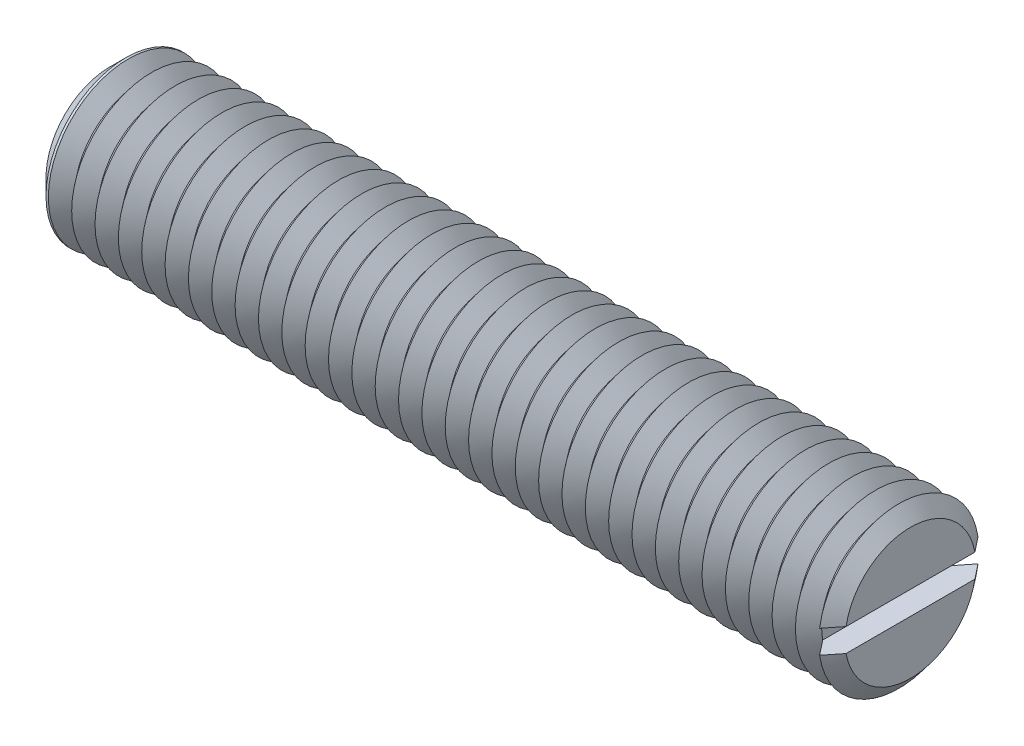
ISO-10303-21;
HEADER;
FILE_DESCRIPTION(('STEP AP214'),'2;1');
FILE_NAME('part.step','',(''),(''),'','','');
FILE_SCHEMA(('AUTOMOTIVE_DESIGN { 1 0 10303 214 1 1 1 1 }'));
ENDSEC;
DATA;
#1=APPLICATION_CONTEXT('core data for automotive mechanical design processes');
#2=APPLICATION_PROTOCOL_DEFINITION('international standard','automotive_design',2000,#1);
#3=PRODUCT_CONTEXT('',#1,'mechanical');
#4=PRODUCT('Part','Part','',(#3));
#5=PRODUCT_RELATED_PRODUCT_CATEGORY('part','',(#4));
#6=PRODUCT_DEFINITION_FORMATION('','',#4);
#7=PRODUCT_DEFINITION_CONTEXT('part definition',#1,'design');
#8=PRODUCT_DEFINITION('design','',#6,#7);
#9=PRODUCT_DEFINITION_SHAPE('','',#8);
#10=(LENGTH_UNIT() NAMED_UNIT(*) SI_UNIT(.MILLI.,.METRE.));
#11=(NAMED_UNIT(*) PLANE_ANGLE_UNIT() SI_UNIT($,.RADIAN.));
#12=(NAMED_UNIT(*) SI_UNIT($,.STERADIAN.) SOLID_ANGLE_UNIT());
#13=UNCERTAINTY_MEASURE_WITH_UNIT(LENGTH_MEASURE(1.E-05),#10,'distance_accuracy_value','');
#14=(GEOMETRIC_REPRESENTATION_CONTEXT(3) GLOBAL_UNCERTAINTY_ASSIGNED_CONTEXT((#13)) GLOBAL_UNIT_ASSIGNED_CONTEXT((#10,
#11,#12)) REPRESENTATION_CONTEXT('',''));
#15=CARTESIAN_POINT('',(0.,0.,0.));
#16=DIRECTION('',(0.,0.,1.));
#17=DIRECTION('',(1.,0.,0.));
#18=AXIS2_PLACEMENT_3D('',#15,#16,#17);
#19=CARTESIAN_POINT('',(29.125,0.,0.));
#20=DIRECTION('',(1.,0.,0.));
#21=DIRECTION('',(0.,0.,-1.));
#22=AXIS2_PLACEMENT_3D('',#19,#20,#21);
#23=CONICAL_SURFACE('',#22,6.,0.895664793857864);
#24=CARTESIAN_POINT('',(29.125,0.,0.));
#25=DIRECTION('',(-1.,0.,0.));
#26=DIRECTION('',(0.,0.,1.));
#27=AXIS2_PLACEMENT_3D('',#24,#25,#26);
#28=CIRCLE('',#27,6.);
#29=CARTESIAN_POINT('',(29.125,-0.875,-5.93585503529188));
#30=VERTEX_POINT('',#29);
#31=CARTESIAN_POINT('',(29.125,-0.875,5.93585503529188));
#32=VERTEX_POINT('',#31);
#33=EDGE_CURVE('E117',#30,#32,#28,.T.);
#34=ORIENTED_EDGE('',*,*,#33,.T.);
#35=CARTESIAN_POINT('',(34.815666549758,-0.875,-13.0784023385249));
#36=CARTESIAN_POINT('',(34.4425848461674,-0.875,-12.6113718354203));
#37=CARTESIAN_POINT('',(34.0695485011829,-0.875,-12.1443050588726));
#38=CARTESIAN_POINT('',(33.3235952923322,-0.875,-11.2100035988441));
#39=CARTESIAN_POINT('',(32.9506784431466,-0.875,-10.7427689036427));
#40=CARTESIAN_POINT('',(32.2043910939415,-0.875,-9.80728158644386));
#41=CARTESIAN_POINT('',(31.8310209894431,-0.875,-9.33902864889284));
#42=CARTESIAN_POINT('',(31.084654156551,-0.875,-8.40229688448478));
#43=CARTESIAN_POINT('',(30.7116573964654,-0.875,-7.93381808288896));
#44=CARTESIAN_POINT('',(30.1431910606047,-0.875,-7.21894008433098));
#45=CARTESIAN_POINT('',(29.9475150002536,-0.875,-6.97270509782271));
#46=CARTESIAN_POINT('',(29.5563780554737,-0.875,-6.48006014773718));
#47=CARTESIAN_POINT('',(29.3609171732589,-0.875,-6.23365018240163));
#48=CARTESIAN_POINT('',(28.9702437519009,-0.875,-5.7405159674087));
#49=CARTESIAN_POINT('',(28.7750313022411,-0.875,-5.49379164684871));
#50=CARTESIAN_POINT('',(28.3850627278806,-0.875,-4.99999724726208));
#51=CARTESIAN_POINT('',(28.1903065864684,-0.875,-4.75292718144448));
#52=CARTESIAN_POINT('',(27.8017454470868,-0.875,-4.2585469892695));
#53=CARTESIAN_POINT('',(27.6079395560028,-0.875,-4.01123756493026));
#54=CARTESIAN_POINT('',(27.2214614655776,-0.875,-3.51567639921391));
#55=CARTESIAN_POINT('',(27.0287894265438,-0.875,-3.26742453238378));
#56=CARTESIAN_POINT('',(26.7415141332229,-0.875,-2.89382702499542));
#57=CARTESIAN_POINT('',(26.6460716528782,-0.875,-2.76912721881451));
#58=CARTESIAN_POINT('',(26.4560120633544,-0.875,-2.51908954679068));
#59=CARTESIAN_POINT('',(26.3613949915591,-0.875,-2.39375165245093));
#60=CARTESIAN_POINT('',(26.1734585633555,-0.875,-2.14215479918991));
#61=CARTESIAN_POINT('',(26.0801388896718,-0.875,-2.01589607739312));
#62=CARTESIAN_POINT('',(25.8955738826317,-0.875,-1.7618740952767));
#63=CARTESIAN_POINT('',(25.8043283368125,-0.875,-1.63411099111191));
#64=CARTESIAN_POINT('',(25.6947335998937,-0.875,-1.47575777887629));
#65=CARTESIAN_POINT('',(25.6745750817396,-0.875,-1.44642115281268));
#66=CARTESIAN_POINT('',(25.6344943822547,-0.875,-1.38758643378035));
#67=CARTESIAN_POINT('',(25.6145722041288,-0.875,-1.35808833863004));
#68=CARTESIAN_POINT('',(25.5552118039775,-0.875,-1.26931303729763));
#69=CARTESIAN_POINT('',(25.5161833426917,-0.875,-1.20976002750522));
#70=CARTESIAN_POINT('',(25.439598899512,-0.875,-1.08955604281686));
#71=CARTESIAN_POINT('',(25.4020457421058,-0.875,-1.02890325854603));
#72=CARTESIAN_POINT('',(25.3292052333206,-0.875,-0.906252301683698));
#73=CARTESIAN_POINT('',(25.2939174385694,-0.875,-0.844254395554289));
#74=CARTESIAN_POINT('',(25.2387563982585,-0.875,-0.74080235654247));
#75=CARTESIAN_POINT('',(25.217869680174,-0.875,-0.699896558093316));
#76=CARTESIAN_POINT('',(25.1780353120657,-0.875,-0.617162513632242));
#77=CARTESIAN_POINT('',(25.1590880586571,-0.875,-0.575334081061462));
#78=CARTESIAN_POINT('',(25.106232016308,-0.875,-0.448426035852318));
#79=CARTESIAN_POINT('',(25.0761075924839,-0.875,-0.361569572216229));
#80=CARTESIAN_POINT('',(25.0472166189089,-0.875,-0.240214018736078));
#81=CARTESIAN_POINT('',(25.0406925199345,-0.875,-0.207555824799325));
#82=CARTESIAN_POINT('',(25.0303887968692,-0.875,-0.141816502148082));
#83=CARTESIAN_POINT('',(25.0266076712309,-0.875,-0.108735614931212));
#84=CARTESIAN_POINT('',(25.0220436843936,-0.875,-0.0424543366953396));
#85=CARTESIAN_POINT('',(25.0212526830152,-0.875,-0.00925451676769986));
#86=CARTESIAN_POINT('',(25.022702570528,-0.875,0.0570804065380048));
#87=CARTESIAN_POINT('',(25.0249438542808,-0.875,0.0902155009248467));
#88=CARTESIAN_POINT('',(25.0331880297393,-0.875,0.164063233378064));
#89=CARTESIAN_POINT('',(25.0399634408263,-0.875,0.204689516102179));
#90=CARTESIAN_POINT('',(25.0573167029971,-0.875,0.28512674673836));
#91=CARTESIAN_POINT('',(25.0678973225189,-0.875,0.324937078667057));
#92=CARTESIAN_POINT('',(25.0921930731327,-0.875,0.403898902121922));
#93=CARTESIAN_POINT('',(25.1059311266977,-0.875,0.44304320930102));
#94=CARTESIAN_POINT('',(25.1357974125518,-0.875,0.520385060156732));
#95=CARTESIAN_POINT('',(25.151925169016,-0.875,0.558582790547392));
#96=CARTESIAN_POINT('',(25.2021457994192,-0.875,0.669991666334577));
#97=CARTESIAN_POINT('',(25.2387706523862,-0.875,0.742052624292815));
#98=CARTESIAN_POINT('',(25.316117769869,-0.875,0.883956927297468));
#99=CARTESIAN_POINT('',(25.3568440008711,-0.875,0.953798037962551));
#100=CARTESIAN_POINT('',(25.4409804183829,-0.875,1.09208391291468));
#101=CARTESIAN_POINT('',(25.4843973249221,-0.875,1.16052456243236));
#102=CARTESIAN_POINT('',(25.5729384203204,-0.875,1.29629435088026));
#103=CARTESIAN_POINT('',(25.618062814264,-0.875,1.36362335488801));
#104=CARTESIAN_POINT('',(25.7096565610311,-0.875,1.49772496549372));
#105=CARTESIAN_POINT('',(25.7561302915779,-0.875,1.56449457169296));
#106=CARTESIAN_POINT('',(25.8499281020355,-0.875,1.69744165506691));
#107=CARTESIAN_POINT('',(25.8972522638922,-0.875,1.76361907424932));
#108=CARTESIAN_POINT('',(25.9924358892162,-0.875,1.89539956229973));
#109=CARTESIAN_POINT('',(26.0402941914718,-0.875,1.96100347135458));
#110=CARTESIAN_POINT('',(26.136481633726,-0.875,2.09186112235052));
#111=CARTESIAN_POINT('',(26.1848107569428,-0.875,2.15711487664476));
#112=CARTESIAN_POINT('',(26.3290907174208,-0.875,2.35079303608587));
#113=CARTESIAN_POINT('',(26.425565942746,-0.875,2.47882657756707));
#114=CARTESIAN_POINT('',(26.6194152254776,-0.875,2.73421191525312));
#115=CARTESIAN_POINT('',(26.716789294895,-0.875,2.86156370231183));
#116=CARTESIAN_POINT('',(27.0098183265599,-0.875,3.24294102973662));
#117=CARTESIAN_POINT('',(27.2063709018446,-0.875,3.49627631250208));
#118=CARTESIAN_POINT('',(27.6008478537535,-0.875,4.00219025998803));
#119=CARTESIAN_POINT('',(27.7987731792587,-0.875,4.25476818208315));
#120=CARTESIAN_POINT('',(28.1953507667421,-0.875,4.75934213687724));
#121=CARTESIAN_POINT('',(28.394003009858,-0.875,5.01133818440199));
#122=CARTESIAN_POINT('',(28.7908446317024,-0.875,5.51379367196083));
#123=CARTESIAN_POINT('',(28.9890318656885,-0.875,5.76425480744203));
#124=CARTESIAN_POINT('',(29.3857195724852,-0.875,6.26493161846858));
#125=CARTESIAN_POINT('',(29.5842200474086,-0.875,6.51514729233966));
#126=CARTESIAN_POINT('',(30.1799499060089,-0.875,7.26541710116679));
#127=CARTESIAN_POINT('',(30.5775028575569,-0.875,7.76521426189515));
#128=CARTESIAN_POINT('',(31.294311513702,-0.875,8.6655030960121));
#129=CARTESIAN_POINT('',(31.6134832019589,-0.875,9.06606170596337));
#130=CARTESIAN_POINT('',(32.2520581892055,-0.875,9.86704239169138));
#131=CARTESIAN_POINT('',(32.5714615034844,-0.875,10.2674644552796));
#132=CARTESIAN_POINT('',(33.2116162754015,-0.875,11.0697025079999));
#133=CARTESIAN_POINT('',(33.5323682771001,-0.875,11.4715180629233));
#134=CARTESIAN_POINT('',(34.1739570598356,-0.875,12.2750327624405));
#135=CARTESIAN_POINT('',(34.4947938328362,-0.875,12.6767319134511));
#136=CARTESIAN_POINT('',(34.815666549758,-0.875,13.0784023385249));
#137=B_SPLINE_CURVE_WITH_KNOTS('',3,(#35,#36,#37,#38,#39,#40,#41,#42,#43,#44,#45,#46,#47,#48,
#49,#50,#51,#52,#53,#54,#55,#56,#57,#58,#59,#60,#61,#62,#63,#64,#65,#66,#67,#68,#69,#70,#71,#72,
#73,#74,#75,#76,#77,#78,#79,#80,#81,#82,#83,#84,#85,#86,#87,#88,#89,#90,#91,#92,#93,#94,#95,#96,
#97,#98,#99,#100,#101,#102,#103,#104,#105,#106,#107,#108,#109,#110,#111,#112,#113,#114,#115,
#116,#117,#118,#119,#120,#121,#122,#123,#124,#125,#126,#127,#128,#129,#130,#131,#132,#133,#134,
#135,#136),.UNSPECIFIED.,.F.,.F.,(4,2,2,2,2,2,2,2,2,2,2,2,2,2,2,2,2,2,2,2,2,2,2,2,2,2,2,2,2,2,2,
2,2,2,2,2,2,2,2,2,2,2,2,2,2,2,2,2,2,2,4),(0.,1.79325603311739,3.58668207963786,5.38334403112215,
7.17983772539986,8.12338791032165,9.06694771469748,10.0107838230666,10.9545848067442,
11.8971886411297,12.8399226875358,13.3110192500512,13.7821370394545,14.2531375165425,
14.72408952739,14.8308734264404,14.9376587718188,15.1512485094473,15.3652290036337,
15.5791674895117,15.7169026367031,15.8546658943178,16.1289739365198,16.2287885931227,
16.3285485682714,16.4280367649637,16.5275379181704,16.6508760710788,16.7743041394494,
16.8986582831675,17.0229876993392,17.2652294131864,17.5077076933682,17.7508180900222,
17.9939577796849,18.2380016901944,18.4820692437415,18.7256822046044,18.9692865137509,
19.4502162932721,19.9311525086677,20.8930708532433,21.855738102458,22.8183805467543,
23.7765455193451,24.7347169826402,26.6505999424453,28.1871088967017,29.7237307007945,
31.2661438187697,32.8084427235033),.UNSPECIFIED.);
#138=CARTESIAN_POINT('',(28.25,-0.875,4.82848363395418));
#139=VERTEX_POINT('',#138);
#140=EDGE_CURVE('E109',#139,#32,#137,.T.);
#141=ORIENTED_EDGE('',*,*,#140,.F.);
#142=CARTESIAN_POINT('',(28.25,0.,0.));
#143=DIRECTION('',(-1.,0.,0.));
#144=DIRECTION('',(0.,0.,1.));
#145=AXIS2_PLACEMENT_3D('',#142,#143,#144);
#146=CIRCLE('',#145,4.90712535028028);
#147=CARTESIAN_POINT('',(28.25,-0.875,-4.82848363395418));
#148=VERTEX_POINT('',#147);
#149=EDGE_CURVE('E488',#148,#139,#146,.T.);
#150=ORIENTED_EDGE('',*,*,#149,.F.);
#151=EDGE_CURVE('E58',#30,#148,#137,.T.);
#152=ORIENTED_EDGE('',*,*,#151,.F.);
#153=EDGE_LOOP('',(#34,#141,#150,#152));
#154=FACE_BOUND('',#153,.T.);
#155=ADVANCED_FACE('F37',(#154),#23,.T.);
#156=CARTESIAN_POINT('',(29.125,0.875,5.93585503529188));
#157=VERTEX_POINT('',#156);
#158=CARTESIAN_POINT('',(29.125,0.875,-5.93585503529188));
#159=VERTEX_POINT('',#158);
#160=EDGE_CURVE('E100',#157,#159,#28,.T.);
#161=ORIENTED_EDGE('',*,*,#160,.T.);
#162=CARTESIAN_POINT('',(34.815666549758,0.875,13.0784023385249));
#163=CARTESIAN_POINT('',(34.4425848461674,0.875,12.6113718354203));
#164=CARTESIAN_POINT('',(34.0695485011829,0.875,12.1443050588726));
#165=CARTESIAN_POINT('',(33.3235952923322,0.875,11.2100035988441));
#166=CARTESIAN_POINT('',(32.9506784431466,0.875,10.7427689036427));
#167=CARTESIAN_POINT('',(32.2043910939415,0.875,9.80728158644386));
#168=CARTESIAN_POINT('',(31.8310209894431,0.875,9.33902864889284));
#169=CARTESIAN_POINT('',(31.084654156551,0.875,8.40229688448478));
#170=CARTESIAN_POINT('',(30.7116573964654,0.875,7.93381808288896));
#171=CARTESIAN_POINT('',(30.1431910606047,0.875,7.21894008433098));
#172=CARTESIAN_POINT('',(29.9475150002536,0.875,6.97270509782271));
#173=CARTESIAN_POINT('',(29.5563780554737,0.875,6.48006014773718));
#174=CARTESIAN_POINT('',(29.3609171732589,0.875,6.23365018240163));
#175=CARTESIAN_POINT('',(28.9702437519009,0.875,5.7405159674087));
#176=CARTESIAN_POINT('',(28.7750313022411,0.875,5.49379164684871));
#177=CARTESIAN_POINT('',(28.3850627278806,0.875,4.99999724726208));
#178=CARTESIAN_POINT('',(28.1903065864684,0.875,4.75292718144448));
#179=CARTESIAN_POINT('',(27.8017454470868,0.875,4.2585469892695));
#180=CARTESIAN_POINT('',(27.6079395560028,0.875,4.01123756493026));
#181=CARTESIAN_POINT('',(27.2214614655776,0.875,3.51567639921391));
#182=CARTESIAN_POINT('',(27.0287894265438,0.875,3.26742453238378));
#183=CARTESIAN_POINT('',(26.7415141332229,0.875,2.89382702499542));
#184=CARTESIAN_POINT('',(26.6460716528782,0.875,2.76912721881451));
#185=CARTESIAN_POINT('',(26.4560120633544,0.875,2.51908954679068));
#186=CARTESIAN_POINT('',(26.3613949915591,0.875,2.39375165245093));
#187=CARTESIAN_POINT('',(26.1734585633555,0.875,2.14215479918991));
#188=CARTESIAN_POINT('',(26.0801388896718,0.875,2.01589607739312));
#189=CARTESIAN_POINT('',(25.8955738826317,0.875,1.7618740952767));
#190=CARTESIAN_POINT('',(25.8043283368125,0.875,1.63411099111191));
#191=CARTESIAN_POINT('',(25.6947335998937,0.875,1.47575777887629));
#192=CARTESIAN_POINT('',(25.6745750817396,0.875,1.44642115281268));
#193=CARTESIAN_POINT('',(25.6344943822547,0.875,1.38758643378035));
#194=CARTESIAN_POINT('',(25.6145722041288,0.875,1.35808833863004));
#195=CARTESIAN_POINT('',(25.5552118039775,0.875,1.26931303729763));
#196=CARTESIAN_POINT('',(25.5161833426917,0.875,1.20976002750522));
#197=CARTESIAN_POINT('',(25.439598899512,0.875,1.08955604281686));
#198=CARTESIAN_POINT('',(25.4020457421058,0.875,1.02890325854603));
#199=CARTESIAN_POINT('',(25.3292052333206,0.875,0.906252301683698));
#200=CARTESIAN_POINT('',(25.2939174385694,0.875,0.844254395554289));
#201=CARTESIAN_POINT('',(25.2387563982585,0.875,0.74080235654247));
#202=CARTESIAN_POINT('',(25.217869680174,0.875,0.699896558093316));
#203=CARTESIAN_POINT('',(25.1780353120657,0.875,0.617162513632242));
#204=CARTESIAN_POINT('',(25.1590880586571,0.875,0.575334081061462));
#205=CARTESIAN_POINT('',(25.106232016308,0.875,0.448426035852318));
#206=CARTESIAN_POINT('',(25.0761075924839,0.875,0.361569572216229));
#207=CARTESIAN_POINT('',(25.0472166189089,0.875,0.240214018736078));
#208=CARTESIAN_POINT('',(25.0406925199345,0.875,0.207555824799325));
#209=CARTESIAN_POINT('',(25.0303887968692,0.875,0.141816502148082));
#210=CARTESIAN_POINT('',(25.0266076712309,0.875,0.108735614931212));
#211=CARTESIAN_POINT('',(25.0220436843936,0.875,0.0424543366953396));
#212=CARTESIAN_POINT('',(25.0212526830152,0.875,0.00925451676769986));
#213=CARTESIAN_POINT('',(25.022702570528,0.875,-0.0570804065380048));
#214=CARTESIAN_POINT('',(25.0249438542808,0.875,-0.0902155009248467));
#215=CARTESIAN_POINT('',(25.0331880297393,0.875,-0.164063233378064));
#216=CARTESIAN_POINT('',(25.0399634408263,0.875,-0.204689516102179));
#217=CARTESIAN_POINT('',(25.0573167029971,0.875,-0.28512674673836));
#218=CARTESIAN_POINT('',(25.0678973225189,0.875,-0.324937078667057));
#219=CARTESIAN_POINT('',(25.0921930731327,0.875,-0.403898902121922));
#220=CARTESIAN_POINT('',(25.1059311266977,0.875,-0.44304320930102));
#221=CARTESIAN_POINT('',(25.1357974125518,0.875,-0.520385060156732));
#222=CARTESIAN_POINT('',(25.151925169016,0.875,-0.558582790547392));
#223=CARTESIAN_POINT('',(25.2021457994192,0.875,-0.669991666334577));
#224=CARTESIAN_POINT('',(25.2387706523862,0.875,-0.742052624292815));
#225=CARTESIAN_POINT('',(25.316117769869,0.875,-0.883956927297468));
#226=CARTESIAN_POINT('',(25.3568440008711,0.875,-0.953798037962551));
#227=CARTESIAN_POINT('',(25.4409804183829,0.875,-1.09208391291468));
#228=CARTESIAN_POINT('',(25.4843973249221,0.875,-1.16052456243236));
#229=CARTESIAN_POINT('',(25.5729384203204,0.875,-1.29629435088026));
#230=CARTESIAN_POINT('',(25.618062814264,0.875,-1.36362335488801));
#231=CARTESIAN_POINT('',(25.7096565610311,0.875,-1.49772496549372));
#232=CARTESIAN_POINT('',(25.7561302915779,0.875,-1.56449457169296));
#233=CARTESIAN_POINT('',(25.8499281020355,0.875,-1.69744165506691));
#234=CARTESIAN_POINT('',(25.8972522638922,0.875,-1.76361907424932));
#235=CARTESIAN_POINT('',(25.9924358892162,0.875,-1.89539956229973));
#236=CARTESIAN_POINT('',(26.0402941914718,0.875,-1.96100347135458));
#237=CARTESIAN_POINT('',(26.136481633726,0.875,-2.09186112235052));
#238=CARTESIAN_POINT('',(26.1848107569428,0.875,-2.15711487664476));
#239=CARTESIAN_POINT('',(26.3290907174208,0.875,-2.35079303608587));
#240=CARTESIAN_POINT('',(26.425565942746,0.875,-2.47882657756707));
#241=CARTESIAN_POINT('',(26.6194152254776,0.875,-2.73421191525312));
#242=CARTESIAN_POINT('',(26.716789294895,0.875,-2.86156370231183));
#243=CARTESIAN_POINT('',(27.0098183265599,0.875,-3.24294102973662));
#244=CARTESIAN_POINT('',(27.2063709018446,0.875,-3.49627631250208));
#245=CARTESIAN_POINT('',(27.6008478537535,0.875,-4.00219025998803));
#246=CARTESIAN_POINT('',(27.7987731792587,0.875,-4.25476818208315));
#247=CARTESIAN_POINT('',(28.1953507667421,0.875,-4.75934213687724));
#248=CARTESIAN_POINT('',(28.394003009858,0.875,-5.01133818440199));
#249=CARTESIAN_POINT('',(28.7908446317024,0.875,-5.51379367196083));
#250=CARTESIAN_POINT('',(28.9890318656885,0.875,-5.76425480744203));
#251=CARTESIAN_POINT('',(29.3857195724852,0.875,-6.26493161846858));
#252=CARTESIAN_POINT('',(29.5842200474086,0.875,-6.51514729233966));
#253=CARTESIAN_POINT('',(30.1799499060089,0.875,-7.26541710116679));
#254=CARTESIAN_POINT('',(30.5775028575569,0.875,-7.76521426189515));
#255=CARTESIAN_POINT('',(31.294311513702,0.875,-8.6655030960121));
#256=CARTESIAN_POINT('',(31.6134832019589,0.875,-9.06606170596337));
#257=CARTESIAN_POINT('',(32.2520581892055,0.875,-9.86704239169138));
#258=CARTESIAN_POINT('',(32.5714615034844,0.875,-10.2674644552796));
#259=CARTESIAN_POINT('',(33.2116162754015,0.875,-11.0697025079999));
#260=CARTESIAN_POINT('',(33.5323682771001,0.875,-11.4715180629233));
#261=CARTESIAN_POINT('',(34.1739570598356,0.875,-12.2750327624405));
#262=CARTESIAN_POINT('',(34.4947938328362,0.875,-12.6767319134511));
#263=CARTESIAN_POINT('',(34.815666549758,0.875,-13.0784023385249));
#264=B_SPLINE_CURVE_WITH_KNOTS('',3,(#162,#163,#164,#165,#166,#167,#168,#169,#170,#171,#172,
#173,#174,#175,#176,#177,#178,#179,#180,#181,#182,#183,#184,#185,#186,#187,#188,#189,#190,#191,
#192,#193,#194,#195,#196,#197,#198,#199,#200,#201,#202,#203,#204,#205,#206,#207,#208,#209,#210,
#211,#212,#213,#214,#215,#216,#217,#218,#219,#220,#221,#222,#223,#224,#225,#226,#227,#228,#229,
#230,#231,#232,#233,#234,#235,#236,#237,#238,#239,#240,#241,#242,#243,#244,#245,#246,#247,#248,
#249,#250,#251,#252,#253,#254,#255,#256,#257,#258,#259,#260,#261,#262,#263),.UNSPECIFIED.,.F.,
.F.,(4,2,2,2,2,2,2,2,2,2,2,2,2,2,2,2,2,2,2,2,2,2,2,2,2,2,2,2,2,2,2,2,2,2,2,2,2,2,2,2,2,2,2,2,2,
2,2,2,2,2,4),(0.,1.79325603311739,3.58668207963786,5.38334403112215,7.17983772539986,
8.12338791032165,9.06694771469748,10.0107838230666,10.9545848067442,11.8971886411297,
12.8399226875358,13.3110192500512,13.7821370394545,14.2531375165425,14.72408952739,
14.8308734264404,14.9376587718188,15.1512485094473,15.3652290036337,15.5791674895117,
15.7169026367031,15.8546658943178,16.1289739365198,16.2287885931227,16.3285485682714,
16.4280367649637,16.5275379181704,16.6508760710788,16.7743041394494,16.8986582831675,
17.0229876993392,17.2652294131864,17.5077076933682,17.7508180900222,17.9939577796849,
18.2380016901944,18.4820692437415,18.7256822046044,18.9692865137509,19.4502162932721,
19.9311525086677,20.8930708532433,21.855738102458,22.8183805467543,23.7765455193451,
24.7347169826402,26.6505999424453,28.1871088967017,29.7237307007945,31.2661438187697,
32.8084427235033),.UNSPECIFIED.);
#265=CARTESIAN_POINT('',(28.25,0.875,-4.82848363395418));
#266=VERTEX_POINT('',#265);
#267=EDGE_CURVE('E110',#266,#159,#264,.T.);
#268=ORIENTED_EDGE('',*,*,#267,.F.);
#269=CARTESIAN_POINT('',(28.25,0.875,4.82848363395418));
#270=VERTEX_POINT('',#269);
#271=EDGE_CURVE('E103',#270,#266,#146,.T.);
#272=ORIENTED_EDGE('',*,*,#271,.F.);
#273=EDGE_CURVE('E97',#157,#270,#264,.T.);
#274=ORIENTED_EDGE('',*,*,#273,.F.);
#275=EDGE_LOOP('',(#161,#268,#272,#274));
#276=FACE_BOUND('',#275,.T.);
#277=ADVANCED_FACE('F99',(#276),#23,.T.);
#278=CARTESIAN_POINT('',(28.25,0.,0.));
#279=DIRECTION('',(-1.,0.,0.));
#280=DIRECTION('',(0.,0.,1.));
#281=AXIS2_PLACEMENT_3D('',#278,#279,#280);
#282=CONICAL_SURFACE('',#281,4.90712535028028,0.895664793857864);
#283=CARTESIAN_POINT('',(27.375,0.,0.));
#284=DIRECTION('',(-1.,0.,0.));
#285=DIRECTION('',(0.,0.,1.));
#286=AXIS2_PLACEMENT_3D('',#283,#284,#285);
#287=CIRCLE('',#286,6.);
#288=CARTESIAN_POINT('',(27.375,0.,6.));
#289=VERTEX_POINT('',#288);
#290=EDGE_CURVE('E472',#289,#289,#287,.T.);
#291=ORIENTED_EDGE('',*,*,#290,.F.);
#292=EDGE_LOOP('',(#291));
#293=FACE_BOUND('',#292,.T.);
#294=ORIENTED_EDGE('',*,*,#271,.T.);
#295=EDGE_CURVE('E481',#266,#148,#146,.T.);
#296=ORIENTED_EDGE('',*,*,#295,.T.);
#297=ORIENTED_EDGE('',*,*,#149,.T.);
#298=EDGE_CURVE('E479',#139,#270,#146,.T.);
#299=ORIENTED_EDGE('',*,*,#298,.T.);
#300=EDGE_LOOP('',(#294,#296,#297,#299));
#301=FACE_BOUND('',#300,.T.);
#302=ADVANCED_FACE('F168',(#293,#301),#282,.T.);
#303=CARTESIAN_POINT('',(30.,0.,0.));
#304=DIRECTION('',(1.,0.,0.));
#305=DIRECTION('',(0.,0.,-1.));
#306=AXIS2_PLACEMENT_3D('',#303,#304,#305);
#307=PLANE('',#306);
#308=CARTESIAN_POINT('',(30.,0.,0.));
#309=DIRECTION('',(-1.,0.,0.));
#310=DIRECTION('',(0.,0.,1.));
#311=AXIS2_PLACEMENT_3D('',#308,#309,#310);
#312=CIRCLE('',#311,4.90712535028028);
#313=CARTESIAN_POINT('',(30.,0.875,4.82848363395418));
#314=VERTEX_POINT('',#313);
#315=CARTESIAN_POINT('',(30.,0.875,-4.82848363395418));
#316=VERTEX_POINT('',#315);
#317=EDGE_CURVE('E160',#314,#316,#312,.T.);
#318=ORIENTED_EDGE('',*,*,#317,.F.);
#319=DIRECTION('',(0.,0.,1.));
#320=VECTOR('',#319,1.);
#321=CARTESIAN_POINT('',(30.,0.875,0.));
#322=LINE('',#321,#320);
#323=EDGE_CURVE('E122',#316,#314,#322,.T.);
#324=ORIENTED_EDGE('',*,*,#323,.F.);
#325=EDGE_LOOP('',(#318,#324));
#326=FACE_BOUND('',#325,.T.);
#327=ADVANCED_FACE('F172',(#326),#307,.T.);
#328=CARTESIAN_POINT('',(30.,-0.875,-4.82848363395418));
#329=VERTEX_POINT('',#328);
#330=CARTESIAN_POINT('',(30.,-0.875,4.82848363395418));
#331=VERTEX_POINT('',#330);
#332=EDGE_CURVE('E66',#329,#331,#312,.T.);
#333=ORIENTED_EDGE('',*,*,#332,.F.);
#334=DIRECTION('',(0.,0.,-1.));
#335=VECTOR('',#334,1.);
#336=CARTESIAN_POINT('',(30.,-0.875,0.));
#337=LINE('',#336,#335);
#338=EDGE_CURVE('E136',#331,#329,#337,.T.);
#339=ORIENTED_EDGE('',*,*,#338,.F.);
#340=EDGE_LOOP('',(#333,#339));
#341=FACE_BOUND('',#340,.T.);
#342=ADVANCED_FACE('F201',(#341),#307,.T.);
#343=CARTESIAN_POINT('',(30.,0.,0.));
#344=DIRECTION('',(-1.,0.,0.));
#345=DIRECTION('',(0.,0.,1.));
#346=AXIS2_PLACEMENT_3D('',#343,#344,#345);
#347=CONICAL_SURFACE('',#346,4.90712535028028,0.895664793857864);
#348=ORIENTED_EDGE('',*,*,#160,.F.);
#349=CARTESIAN_POINT('',(23.434333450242,0.875,-13.0784023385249));
#350=CARTESIAN_POINT('',(23.8074151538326,0.875,-12.6113718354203));
#351=CARTESIAN_POINT('',(24.1804514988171,0.875,-12.1443050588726));
#352=CARTESIAN_POINT('',(24.9264047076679,0.875,-11.2100035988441));
#353=CARTESIAN_POINT('',(25.2993215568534,0.875,-10.7427689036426));
#354=CARTESIAN_POINT('',(26.0456089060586,0.875,-9.80728158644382));
#355=CARTESIAN_POINT('',(26.418979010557,0.875,-9.3390286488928));
#356=CARTESIAN_POINT('',(27.165345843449,0.875,-8.40229688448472));
#357=CARTESIAN_POINT('',(27.5383426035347,0.875,-7.9338180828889));
#358=CARTESIAN_POINT('',(28.1068089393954,0.875,-7.21894008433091));
#359=CARTESIAN_POINT('',(28.3024849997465,0.875,-6.97270509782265));
#360=CARTESIAN_POINT('',(28.6936219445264,0.875,-6.48006014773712));
#361=CARTESIAN_POINT('',(28.8890828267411,0.875,-6.23365018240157));
#362=CARTESIAN_POINT('',(29.2797562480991,0.875,-5.74051596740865));
#363=CARTESIAN_POINT('',(29.474968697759,0.875,-5.49379164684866));
#364=CARTESIAN_POINT('',(29.8649372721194,0.875,-4.99999724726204));
#365=CARTESIAN_POINT('',(30.0596934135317,0.875,-4.75292718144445));
#366=CARTESIAN_POINT('',(30.4482545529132,0.875,-4.25854698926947));
#367=CARTESIAN_POINT('',(30.6420604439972,0.875,-4.01123756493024));
#368=CARTESIAN_POINT('',(31.0285385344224,0.875,-3.51567639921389));
#369=CARTESIAN_POINT('',(31.2212105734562,0.875,-3.26742453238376));
#370=CARTESIAN_POINT('',(31.5084858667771,0.875,-2.89382702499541));
#371=CARTESIAN_POINT('',(31.6039283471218,0.875,-2.76912721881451));
#372=CARTESIAN_POINT('',(31.7939879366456,0.875,-2.51908954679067));
#373=CARTESIAN_POINT('',(31.8886050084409,0.875,-2.39375165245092));
#374=CARTESIAN_POINT('',(32.0765414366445,0.875,-2.14215479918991));
#375=CARTESIAN_POINT('',(32.1698611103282,0.875,-2.01589607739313));
#376=CARTESIAN_POINT('',(32.3544261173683,0.875,-1.7618740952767));
#377=CARTESIAN_POINT('',(32.4456716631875,0.875,-1.63411099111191));
#378=CARTESIAN_POINT('',(32.5552664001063,0.875,-1.47575777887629));
#379=CARTESIAN_POINT('',(32.5754249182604,0.875,-1.44642115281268));
#380=CARTESIAN_POINT('',(32.6155056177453,0.875,-1.38758643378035));
#381=CARTESIAN_POINT('',(32.6354277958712,0.875,-1.35808833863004));
#382=CARTESIAN_POINT('',(32.6947881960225,0.875,-1.26931303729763));
#383=CARTESIAN_POINT('',(32.7338166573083,0.875,-1.20976002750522));
#384=CARTESIAN_POINT('',(32.810401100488,0.875,-1.08955604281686));
#385=CARTESIAN_POINT('',(32.8479542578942,0.875,-1.02890325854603));
#386=CARTESIAN_POINT('',(32.9207947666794,0.875,-0.906252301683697));
#387=CARTESIAN_POINT('',(32.9560825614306,0.875,-0.844254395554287));
#388=CARTESIAN_POINT('',(33.0112436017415,0.875,-0.740802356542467));
#389=CARTESIAN_POINT('',(33.032130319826,0.875,-0.699896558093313));
#390=CARTESIAN_POINT('',(33.0719646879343,0.875,-0.61716251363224));
#391=CARTESIAN_POINT('',(33.0909119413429,0.875,-0.57533408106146));
#392=CARTESIAN_POINT('',(33.143767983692,0.875,-0.448426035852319));
#393=CARTESIAN_POINT('',(33.1738924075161,0.875,-0.361569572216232));
#394=CARTESIAN_POINT('',(33.2027833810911,0.875,-0.240214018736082));
#395=CARTESIAN_POINT('',(33.2093074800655,0.875,-0.207555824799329));
#396=CARTESIAN_POINT('',(33.2196112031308,0.875,-0.141816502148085));
#397=CARTESIAN_POINT('',(33.2233923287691,0.875,-0.108735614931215));
#398=CARTESIAN_POINT('',(33.2279563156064,0.875,-0.0424543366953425));
#399=CARTESIAN_POINT('',(33.2287473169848,0.875,-0.00925451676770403));
#400=CARTESIAN_POINT('',(33.2272974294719,0.875,0.0570804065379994));
#401=CARTESIAN_POINT('',(33.2250561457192,0.875,0.0902155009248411));
#402=CARTESIAN_POINT('',(33.2168119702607,0.875,0.164063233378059));
#403=CARTESIAN_POINT('',(33.2100365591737,0.875,0.204689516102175));
#404=CARTESIAN_POINT('',(33.1926832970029,0.875,0.285126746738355));
#405=CARTESIAN_POINT('',(33.1821026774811,0.875,0.324937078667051));
#406=CARTESIAN_POINT('',(33.1578069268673,0.875,0.403898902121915));
#407=CARTESIAN_POINT('',(33.1440688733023,0.875,0.443043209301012));
#408=CARTESIAN_POINT('',(33.1142025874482,0.875,0.520385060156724));
#409=CARTESIAN_POINT('',(33.098074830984,0.875,0.558582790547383));
#410=CARTESIAN_POINT('',(33.0478542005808,0.875,0.669991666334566));
#411=CARTESIAN_POINT('',(33.0112293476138,0.875,0.742052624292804));
#412=CARTESIAN_POINT('',(32.933882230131,0.875,0.883956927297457));
#413=CARTESIAN_POINT('',(32.8931559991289,0.875,0.953798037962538));
#414=CARTESIAN_POINT('',(32.8090195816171,0.875,1.09208391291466));
#415=CARTESIAN_POINT('',(32.7656026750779,0.875,1.16052456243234));
#416=CARTESIAN_POINT('',(32.6770615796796,0.875,1.29629435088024));
#417=CARTESIAN_POINT('',(32.631937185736,0.875,1.36362335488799));
#418=CARTESIAN_POINT('',(32.5403434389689,0.875,1.49772496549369));
#419=CARTESIAN_POINT('',(32.4938697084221,0.875,1.56449457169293));
#420=CARTESIAN_POINT('',(32.4000718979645,0.875,1.69744165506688));
#421=CARTESIAN_POINT('',(32.3527477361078,0.875,1.76361907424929));
#422=CARTESIAN_POINT('',(32.2575641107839,0.875,1.89539956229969));
#423=CARTESIAN_POINT('',(32.2097058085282,0.875,1.96100347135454));
#424=CARTESIAN_POINT('',(32.113518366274,0.875,2.09186112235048));
#425=CARTESIAN_POINT('',(32.0651892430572,0.875,2.15711487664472));
#426=CARTESIAN_POINT('',(31.9209092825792,0.875,2.35079303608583));
#427=CARTESIAN_POINT('',(31.824434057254,0.875,2.47882657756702));
#428=CARTESIAN_POINT('',(31.6305847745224,0.875,2.73421191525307));
#429=CARTESIAN_POINT('',(31.533210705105,0.875,2.86156370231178));
#430=CARTESIAN_POINT('',(31.2401816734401,0.875,3.24294102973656));
#431=CARTESIAN_POINT('',(31.0436290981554,0.875,3.49627631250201));
#432=CARTESIAN_POINT('',(30.6491521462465,0.875,4.00219025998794));
#433=CARTESIAN_POINT('',(30.4512268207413,0.875,4.25476818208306));
#434=CARTESIAN_POINT('',(30.054649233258,0.875,4.75934213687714));
#435=CARTESIAN_POINT('',(29.8559969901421,0.875,5.01133818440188));
#436=CARTESIAN_POINT('',(29.4591553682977,0.875,5.5137936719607));
#437=CARTESIAN_POINT('',(29.2609681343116,0.875,5.7642548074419));
#438=CARTESIAN_POINT('',(28.8642804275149,0.875,6.26493161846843));
#439=CARTESIAN_POINT('',(28.6657799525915,0.875,6.51514729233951));
#440=CARTESIAN_POINT('',(28.0700500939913,0.875,7.26541710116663));
#441=CARTESIAN_POINT('',(27.6724971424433,0.875,7.76521426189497));
#442=CARTESIAN_POINT('',(26.9556884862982,0.875,8.66550309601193));
#443=CARTESIAN_POINT('',(26.6365167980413,0.875,9.06606170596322));
#444=CARTESIAN_POINT('',(25.9979418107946,0.875,9.86704239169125));
#445=CARTESIAN_POINT('',(25.6785384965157,0.875,10.2674644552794));
#446=CARTESIAN_POINT('',(25.0383837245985,0.875,11.0697025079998));
#447=CARTESIAN_POINT('',(24.7176317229,0.875,11.4715180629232));
#448=CARTESIAN_POINT('',(24.0760429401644,0.875,12.2750327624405));
#449=CARTESIAN_POINT('',(23.7552061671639,0.875,12.6767319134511));
#450=CARTESIAN_POINT('',(23.434333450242,0.875,13.0784023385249));
#451=B_SPLINE_CURVE_WITH_KNOTS('',3,(#349,#350,#351,#352,#353,#354,#355,#356,#357,#358,#359,
#360,#361,#362,#363,#364,#365,#366,#367,#368,#369,#370,#371,#372,#373,#374,#375,#376,#377,#378,
#379,#380,#381,#382,#383,#384,#385,#386,#387,#388,#389,#390,#391,#392,#393,#394,#395,#396,#397,
#398,#399,#400,#401,#402,#403,#404,#405,#406,#407,#408,#409,#410,#411,#412,#413,#414,#415,#416,
#417,#418,#419,#420,#421,#422,#423,#424,#425,#426,#427,#428,#429,#430,#431,#432,#433,#434,#435,
#436,#437,#438,#439,#440,#441,#442,#443,#444,#445,#446,#447,#448,#449,#450),.UNSPECIFIED.,.F.,
.F.,(4,2,2,2,2,2,2,2,2,2,2,2,2,2,2,2,2,2,2,2,2,2,2,2,2,2,2,2,2,2,2,2,2,2,2,2,2,2,2,2,2,2,2,2,2,
2,2,2,2,2,4),(0.,1.79325603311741,3.58668207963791,5.38334403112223,7.17983772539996,
8.12338791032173,9.06694771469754,10.0107838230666,10.9545848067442,11.8971886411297,
12.8399226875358,13.3110192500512,13.7821370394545,14.2531375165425,14.72408952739,
14.8308734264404,14.9376587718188,15.1512485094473,15.3652290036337,15.5791674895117,
15.7169026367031,15.8546658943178,16.1289739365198,16.2287885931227,16.3285485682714,
16.4280367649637,16.5275379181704,16.6508760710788,16.7743041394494,16.8986582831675,
17.0229876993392,17.2652294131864,17.5077076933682,17.7508180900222,17.9939577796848,
18.2380016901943,18.4820692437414,18.7256822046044,18.9692865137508,19.450216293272,
19.9311525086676,20.8930708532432,21.8557381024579,22.8183805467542,23.7765455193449,
24.73471698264,26.6505999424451,28.1871088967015,29.7237307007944,31.2661438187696,
32.8084427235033),.UNSPECIFIED.);
#452=EDGE_CURVE('E41',#314,#157,#451,.T.);
#453=ORIENTED_EDGE('',*,*,#452,.F.);
#454=ORIENTED_EDGE('',*,*,#317,.T.);
#455=EDGE_CURVE('E11',#159,#316,#451,.T.);
#456=ORIENTED_EDGE('',*,*,#455,.F.);
#457=EDGE_LOOP('',(#348,#453,#454,#456));
#458=FACE_BOUND('',#457,.T.);
#459=ADVANCED_FACE('F114',(#458),#347,.T.);
#460=CARTESIAN_POINT('',(30.,0.875,-9.));
#461=DIRECTION('',(0.,1.,0.));
#462=DIRECTION('',(0.,0.,1.));
#463=AXIS2_PLACEMENT_3D('',#460,#461,#462);
#464=PLANE('',#463);
#465=ORIENTED_EDGE('',*,*,#452,.T.);
#466=ORIENTED_EDGE('',*,*,#273,.T.);
#467=DIRECTION('',(0.,0.,1.));
#468=VECTOR('',#467,1.);
#469=CARTESIAN_POINT('',(28.25,0.875,-9.));
#470=LINE('',#469,#468);
#471=EDGE_CURVE('E145',#266,#270,#470,.T.);
#472=ORIENTED_EDGE('',*,*,#471,.F.);
#473=ORIENTED_EDGE('',*,*,#267,.T.);
#474=ORIENTED_EDGE('',*,*,#455,.T.);
#475=ORIENTED_EDGE('',*,*,#323,.T.);
#476=EDGE_LOOP('',(#465,#466,#472,#473,#474,#475));
#477=FACE_BOUND('',#476,.T.);
#478=ADVANCED_FACE('F120',(#477),#464,.F.);
#479=ORIENTED_EDGE('',*,*,#33,.F.);
#480=CARTESIAN_POINT('',(23.434333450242,-0.875,13.0784023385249));
#481=CARTESIAN_POINT('',(23.8074151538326,-0.875,12.6113718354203));
#482=CARTESIAN_POINT('',(24.1804514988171,-0.875,12.1443050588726));
#483=CARTESIAN_POINT('',(24.9264047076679,-0.875,11.2100035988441));
#484=CARTESIAN_POINT('',(25.2993215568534,-0.875,10.7427689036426));
#485=CARTESIAN_POINT('',(26.0456089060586,-0.875,9.80728158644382));
#486=CARTESIAN_POINT('',(26.418979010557,-0.875,9.3390286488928));
#487=CARTESIAN_POINT('',(27.165345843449,-0.875,8.40229688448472));
#488=CARTESIAN_POINT('',(27.5383426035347,-0.875,7.9338180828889));
#489=CARTESIAN_POINT('',(28.1068089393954,-0.875,7.21894008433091));
#490=CARTESIAN_POINT('',(28.3024849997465,-0.875,6.97270509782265));
#491=CARTESIAN_POINT('',(28.6936219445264,-0.875,6.48006014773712));
#492=CARTESIAN_POINT('',(28.8890828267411,-0.875,6.23365018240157));
#493=CARTESIAN_POINT('',(29.2797562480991,-0.875,5.74051596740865));
#494=CARTESIAN_POINT('',(29.474968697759,-0.875,5.49379164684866));
#495=CARTESIAN_POINT('',(29.8649372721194,-0.875,4.99999724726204));
#496=CARTESIAN_POINT('',(30.0596934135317,-0.875,4.75292718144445));
#497=CARTESIAN_POINT('',(30.4482545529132,-0.875,4.25854698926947));
#498=CARTESIAN_POINT('',(30.6420604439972,-0.875,4.01123756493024));
#499=CARTESIAN_POINT('',(31.0285385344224,-0.875,3.51567639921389));
#500=CARTESIAN_POINT('',(31.2212105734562,-0.875,3.26742453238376));
#501=CARTESIAN_POINT('',(31.5084858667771,-0.875,2.89382702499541));
#502=CARTESIAN_POINT('',(31.6039283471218,-0.875,2.76912721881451));
#503=CARTESIAN_POINT('',(31.7939879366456,-0.875,2.51908954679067));
#504=CARTESIAN_POINT('',(31.8886050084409,-0.875,2.39375165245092));
#505=CARTESIAN_POINT('',(32.0765414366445,-0.875,2.14215479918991));
#506=CARTESIAN_POINT('',(32.1698611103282,-0.875,2.01589607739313));
#507=CARTESIAN_POINT('',(32.3544261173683,-0.875,1.7618740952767));
#508=CARTESIAN_POINT('',(32.4456716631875,-0.875,1.63411099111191));
#509=CARTESIAN_POINT('',(32.5552664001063,-0.875,1.47575777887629));
#510=CARTESIAN_POINT('',(32.5754249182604,-0.875,1.44642115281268));
#511=CARTESIAN_POINT('',(32.6155056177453,-0.875,1.38758643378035));
#512=CARTESIAN_POINT('',(32.6354277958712,-0.875,1.35808833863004));
#513=CARTESIAN_POINT('',(32.6947881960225,-0.875,1.26931303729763));
#514=CARTESIAN_POINT('',(32.7338166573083,-0.875,1.20976002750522));
#515=CARTESIAN_POINT('',(32.810401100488,-0.875,1.08955604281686));
#516=CARTESIAN_POINT('',(32.8479542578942,-0.875,1.02890325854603));
#517=CARTESIAN_POINT('',(32.9207947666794,-0.875,0.906252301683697));
#518=CARTESIAN_POINT('',(32.9560825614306,-0.875,0.844254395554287));
#519=CARTESIAN_POINT('',(33.0112436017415,-0.875,0.740802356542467));
#520=CARTESIAN_POINT('',(33.032130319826,-0.875,0.699896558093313));
#521=CARTESIAN_POINT('',(33.0719646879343,-0.875,0.61716251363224));
#522=CARTESIAN_POINT('',(33.0909119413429,-0.875,0.57533408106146));
#523=CARTESIAN_POINT('',(33.143767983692,-0.875,0.448426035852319));
#524=CARTESIAN_POINT('',(33.1738924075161,-0.875,0.361569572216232));
#525=CARTESIAN_POINT('',(33.2027833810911,-0.875,0.240214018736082));
#526=CARTESIAN_POINT('',(33.2093074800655,-0.875,0.207555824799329));
#527=CARTESIAN_POINT('',(33.2196112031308,-0.875,0.141816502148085));
#528=CARTESIAN_POINT('',(33.2233923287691,-0.875,0.108735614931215));
#529=CARTESIAN_POINT('',(33.2279563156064,-0.875,0.0424543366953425));
#530=CARTESIAN_POINT('',(33.2287473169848,-0.875,0.00925451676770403));
#531=CARTESIAN_POINT('',(33.2272974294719,-0.875,-0.0570804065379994));
#532=CARTESIAN_POINT('',(33.2250561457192,-0.875,-0.0902155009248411));
#533=CARTESIAN_POINT('',(33.2168119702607,-0.875,-0.164063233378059));
#534=CARTESIAN_POINT('',(33.2100365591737,-0.875,-0.204689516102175));
#535=CARTESIAN_POINT('',(33.1926832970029,-0.875,-0.285126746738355));
#536=CARTESIAN_POINT('',(33.1821026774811,-0.875,-0.324937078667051));
#537=CARTESIAN_POINT('',(33.1578069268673,-0.875,-0.403898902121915));
#538=CARTESIAN_POINT('',(33.1440688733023,-0.875,-0.443043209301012));
#539=CARTESIAN_POINT('',(33.1142025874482,-0.875,-0.520385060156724));
#540=CARTESIAN_POINT('',(33.098074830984,-0.875,-0.558582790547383));
#541=CARTESIAN_POINT('',(33.0478542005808,-0.875,-0.669991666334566));
#542=CARTESIAN_POINT('',(33.0112293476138,-0.875,-0.742052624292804));
#543=CARTESIAN_POINT('',(32.933882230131,-0.875,-0.883956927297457));
#544=CARTESIAN_POINT('',(32.8931559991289,-0.875,-0.953798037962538));
#545=CARTESIAN_POINT('',(32.8090195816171,-0.875,-1.09208391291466));
#546=CARTESIAN_POINT('',(32.7656026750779,-0.875,-1.16052456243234));
#547=CARTESIAN_POINT('',(32.6770615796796,-0.875,-1.29629435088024));
#548=CARTESIAN_POINT('',(32.631937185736,-0.875,-1.36362335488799));
#549=CARTESIAN_POINT('',(32.5403434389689,-0.875,-1.49772496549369));
#550=CARTESIAN_POINT('',(32.4938697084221,-0.875,-1.56449457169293));
#551=CARTESIAN_POINT('',(32.4000718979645,-0.875,-1.69744165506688));
#552=CARTESIAN_POINT('',(32.3527477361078,-0.875,-1.76361907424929));
#553=CARTESIAN_POINT('',(32.2575641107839,-0.875,-1.89539956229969));
#554=CARTESIAN_POINT('',(32.2097058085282,-0.875,-1.96100347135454));
#555=CARTESIAN_POINT('',(32.113518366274,-0.875,-2.09186112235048));
#556=CARTESIAN_POINT('',(32.0651892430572,-0.875,-2.15711487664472));
#557=CARTESIAN_POINT('',(31.9209092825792,-0.875,-2.35079303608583));
#558=CARTESIAN_POINT('',(31.824434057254,-0.875,-2.47882657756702));
#559=CARTESIAN_POINT('',(31.6305847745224,-0.875,-2.73421191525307));
#560=CARTESIAN_POINT('',(31.533210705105,-0.875,-2.86156370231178));
#561=CARTESIAN_POINT('',(31.2401816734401,-0.875,-3.24294102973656));
#562=CARTESIAN_POINT('',(31.0436290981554,-0.875,-3.49627631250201));
#563=CARTESIAN_POINT('',(30.6491521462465,-0.875,-4.00219025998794));
#564=CARTESIAN_POINT('',(30.4512268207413,-0.875,-4.25476818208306));
#565=CARTESIAN_POINT('',(30.054649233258,-0.875,-4.75934213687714));
#566=CARTESIAN_POINT('',(29.8559969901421,-0.875,-5.01133818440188));
#567=CARTESIAN_POINT('',(29.4591553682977,-0.875,-5.5137936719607));
#568=CARTESIAN_POINT('',(29.2609681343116,-0.875,-5.7642548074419));
#569=CARTESIAN_POINT('',(28.8642804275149,-0.875,-6.26493161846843));
#570=CARTESIAN_POINT('',(28.6657799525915,-0.875,-6.51514729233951));
#571=CARTESIAN_POINT('',(28.0700500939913,-0.875,-7.26541710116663));
#572=CARTESIAN_POINT('',(27.6724971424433,-0.875,-7.76521426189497));
#573=CARTESIAN_POINT('',(26.9556884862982,-0.875,-8.66550309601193));
#574=CARTESIAN_POINT('',(26.6365167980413,-0.875,-9.06606170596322));
#575=CARTESIAN_POINT('',(25.9979418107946,-0.875,-9.86704239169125));
#576=CARTESIAN_POINT('',(25.6785384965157,-0.875,-10.2674644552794));
#577=CARTESIAN_POINT('',(25.0383837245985,-0.875,-11.0697025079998));
#578=CARTESIAN_POINT('',(24.7176317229,-0.875,-11.4715180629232));
#579=CARTESIAN_POINT('',(24.0760429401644,-0.875,-12.2750327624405));
#580=CARTESIAN_POINT('',(23.7552061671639,-0.875,-12.6767319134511));
#581=CARTESIAN_POINT('',(23.434333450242,-0.875,-13.0784023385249));
#582=B_SPLINE_CURVE_WITH_KNOTS('',3,(#480,#481,#482,#483,#484,#485,#486,#487,#488,#489,#490,
#491,#492,#493,#494,#495,#496,#497,#498,#499,#500,#501,#502,#503,#504,#505,#506,#507,#508,#509,
#510,#511,#512,#513,#514,#515,#516,#517,#518,#519,#520,#521,#522,#523,#524,#525,#526,#527,#528,
#529,#530,#531,#532,#533,#534,#535,#536,#537,#538,#539,#540,#541,#542,#543,#544,#545,#546,#547,
#548,#549,#550,#551,#552,#553,#554,#555,#556,#557,#558,#559,#560,#561,#562,#563,#564,#565,#566,
#567,#568,#569,#570,#571,#572,#573,#574,#575,#576,#577,#578,#579,#580,#581),.UNSPECIFIED.,.F.,
.F.,(4,2,2,2,2,2,2,2,2,2,2,2,2,2,2,2,2,2,2,2,2,2,2,2,2,2,2,2,2,2,2,2,2,2,2,2,2,2,2,2,2,2,2,2,2,
2,2,2,2,2,4),(0.,1.79325603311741,3.58668207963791,5.38334403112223,7.17983772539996,
8.12338791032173,9.06694771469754,10.0107838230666,10.9545848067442,11.8971886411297,
12.8399226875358,13.3110192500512,13.7821370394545,14.2531375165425,14.72408952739,
14.8308734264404,14.9376587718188,15.1512485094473,15.3652290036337,15.5791674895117,
15.7169026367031,15.8546658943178,16.1289739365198,16.2287885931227,16.3285485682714,
16.4280367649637,16.5275379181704,16.6508760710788,16.7743041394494,16.8986582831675,
17.0229876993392,17.2652294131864,17.5077076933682,17.7508180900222,17.9939577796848,
18.2380016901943,18.4820692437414,18.7256822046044,18.9692865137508,19.450216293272,
19.9311525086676,20.8930708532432,21.8557381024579,22.8183805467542,23.7765455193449,
24.73471698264,26.6505999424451,28.1871088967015,29.7237307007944,31.2661438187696,
32.8084427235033),.UNSPECIFIED.);
#583=EDGE_CURVE('E152',#329,#30,#582,.T.);
#584=ORIENTED_EDGE('',*,*,#583,.F.);
#585=ORIENTED_EDGE('',*,*,#332,.T.);
#586=EDGE_CURVE('E148',#32,#331,#582,.T.);
#587=ORIENTED_EDGE('',*,*,#586,.F.);
#588=EDGE_LOOP('',(#479,#584,#585,#587));
#589=FACE_BOUND('',#588,.T.);
#590=ADVANCED_FACE('F164',(#589),#347,.T.);
#591=CARTESIAN_POINT('',(30.,-0.875,-9.));
#592=DIRECTION('',(0.,-1.,0.));
#593=DIRECTION('',(0.,0.,-1.));
#594=AXIS2_PLACEMENT_3D('',#591,#592,#593);
#595=PLANE('',#594);
#596=ORIENTED_EDGE('',*,*,#583,.T.);
#597=ORIENTED_EDGE('',*,*,#151,.T.);
#598=DIRECTION('',(0.,0.,1.));
#599=VECTOR('',#598,1.);
#600=CARTESIAN_POINT('',(28.25,-0.875,-9.));
#601=LINE('',#600,#599);
#602=EDGE_CURVE('E144',#148,#139,#601,.T.);
#603=ORIENTED_EDGE('',*,*,#602,.T.);
#604=ORIENTED_EDGE('',*,*,#140,.T.);
#605=ORIENTED_EDGE('',*,*,#586,.T.);
#606=ORIENTED_EDGE('',*,*,#338,.T.);
#607=EDGE_LOOP('',(#596,#597,#603,#604,#605,#606));
#608=FACE_BOUND('',#607,.T.);
#609=ADVANCED_FACE('F161',(#608),#595,.F.);
#610=CARTESIAN_POINT('',(28.25,0.875,-9.));
#611=DIRECTION('',(-1.,0.,0.));
#612=DIRECTION('',(0.,0.,1.));
#613=AXIS2_PLACEMENT_3D('',#610,#611,#612);
#614=PLANE('',#613);
#615=ORIENTED_EDGE('',*,*,#602,.F.);
#616=ORIENTED_EDGE('',*,*,#295,.F.);
#617=ORIENTED_EDGE('',*,*,#471,.T.);
#618=ORIENTED_EDGE('',*,*,#298,.F.);
#619=EDGE_LOOP('',(#615,#616,#617,#618));
#620=FACE_BOUND('',#619,.T.);
#621=ADVANCED_FACE('F493',(#620),#614,.F.);
#622=CARTESIAN_POINT('',(26.5,0.,0.));
#623=DIRECTION('',(-1.,0.,0.));
#624=DIRECTION('',(0.,0.,1.));
#625=AXIS2_PLACEMENT_3D('',#622,#623,#624);
#626=CONICAL_SURFACE('',#625,4.90712535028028,0.895664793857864);
#627=CARTESIAN_POINT('',(25.625,0.,0.));
#628=DIRECTION('',(-1.,0.,0.));
#629=DIRECTION('',(0.,0.,1.));
#630=AXIS2_PLACEMENT_3D('',#627,#628,#629);
#631=CIRCLE('',#630,6.);
#632=CARTESIAN_POINT('',(25.625,0.,6.));
#633=VERTEX_POINT('',#632);
#634=EDGE_CURVE('E464',#633,#633,#631,.T.);
#635=ORIENTED_EDGE('',*,*,#634,.F.);
#636=EDGE_LOOP('',(#635));
#637=FACE_BOUND('',#636,.T.);
#638=CARTESIAN_POINT('',(26.5,0.,0.));
#639=DIRECTION('',(-1.,0.,0.));
#640=DIRECTION('',(0.,0.,1.));
#641=AXIS2_PLACEMENT_3D('',#638,#639,#640);
#642=CIRCLE('',#641,4.90712535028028);
#643=CARTESIAN_POINT('',(26.5,0.,4.90712535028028));
#644=VERTEX_POINT('',#643);
#645=EDGE_CURVE('E476',#644,#644,#642,.T.);
#646=ORIENTED_EDGE('',*,*,#645,.T.);
#647=EDGE_LOOP('',(#646));
#648=FACE_BOUND('',#647,.T.);
#649=ADVANCED_FACE('F177',(#637,#648),#626,.T.);
#650=CARTESIAN_POINT('',(27.375,0.,0.));
#651=DIRECTION('',(1.,0.,0.));
#652=DIRECTION('',(0.,0.,-1.));
#653=AXIS2_PLACEMENT_3D('',#650,#651,#652);
#654=CONICAL_SURFACE('',#653,6.,0.895664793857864);
#655=ORIENTED_EDGE('',*,*,#645,.F.);
#656=EDGE_LOOP('',(#655));
#657=FACE_BOUND('',#656,.T.);
#658=ORIENTED_EDGE('',*,*,#290,.T.);
#659=EDGE_LOOP('',(#658));
#660=FACE_BOUND('',#659,.T.);
#661=ADVANCED_FACE('F499',(#657,#660),#654,.T.);
#662=CARTESIAN_POINT('',(24.75,0.,0.));
#663=DIRECTION('',(-1.,0.,0.));
#664=DIRECTION('',(0.,0.,1.));
#665=AXIS2_PLACEMENT_3D('',#662,#663,#664);
#666=CONICAL_SURFACE('',#665,4.90712535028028,0.895664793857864);
#667=CARTESIAN_POINT('',(23.875,0.,0.));
#668=DIRECTION('',(-1.,0.,0.));
#669=DIRECTION('',(0.,0.,1.));
#670=AXIS2_PLACEMENT_3D('',#667,#668,#669);
#671=CIRCLE('',#670,6.);
#672=CARTESIAN_POINT('',(23.875,0.,6.));
#673=VERTEX_POINT('',#672);
#674=EDGE_CURVE('E456',#673,#673,#671,.T.);
#675=ORIENTED_EDGE('',*,*,#674,.F.);
#676=EDGE_LOOP('',(#675));
#677=FACE_BOUND('',#676,.T.);
#678=CARTESIAN_POINT('',(24.75,0.,0.));
#679=DIRECTION('',(-1.,0.,0.));
#680=DIRECTION('',(0.,0.,1.));
#681=AXIS2_PLACEMENT_3D('',#678,#679,#680);
#682=CIRCLE('',#681,4.90712535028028);
#683=CARTESIAN_POINT('',(24.75,0.,4.90712535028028));
#684=VERTEX_POINT('',#683);
#685=EDGE_CURVE('E468',#684,#684,#682,.T.);
#686=ORIENTED_EDGE('',*,*,#685,.T.);
#687=EDGE_LOOP('',(#686));
#688=FACE_BOUND('',#687,.T.);
#689=ADVANCED_FACE('F563',(#677,#688),#666,.T.);
#690=CARTESIAN_POINT('',(25.625,0.,0.));
#691=DIRECTION('',(1.,0.,0.));
#692=DIRECTION('',(0.,0.,-1.));
#693=AXIS2_PLACEMENT_3D('',#690,#691,#692);
#694=CONICAL_SURFACE('',#693,6.,0.895664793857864);
#695=ORIENTED_EDGE('',*,*,#685,.F.);
#696=EDGE_LOOP('',(#695));
#697=FACE_BOUND('',#696,.T.);
#698=ORIENTED_EDGE('',*,*,#634,.T.);
#699=EDGE_LOOP('',(#698));
#700=FACE_BOUND('',#699,.T.);
#701=ADVANCED_FACE('F572',(#697,#700),#694,.T.);
#702=CARTESIAN_POINT('',(23.,0.,0.));
#703=DIRECTION('',(-1.,0.,0.));
#704=DIRECTION('',(0.,0.,1.));
#705=AXIS2_PLACEMENT_3D('',#702,#703,#704);
#706=CONICAL_SURFACE('',#705,4.90712535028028,0.895664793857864);
#707=CARTESIAN_POINT('',(22.125,0.,0.));
#708=DIRECTION('',(-1.,0.,0.));
#709=DIRECTION('',(0.,0.,1.));
#710=AXIS2_PLACEMENT_3D('',#707,#708,#709);
#711=CIRCLE('',#710,6.);
#712=CARTESIAN_POINT('',(22.125,0.,6.));
#713=VERTEX_POINT('',#712);
#714=EDGE_CURVE('E448',#713,#713,#711,.T.);
#715=ORIENTED_EDGE('',*,*,#714,.F.);
#716=EDGE_LOOP('',(#715));
#717=FACE_BOUND('',#716,.T.);
#718=CARTESIAN_POINT('',(23.,0.,0.));
#719=DIRECTION('',(-1.,0.,0.));
#720=DIRECTION('',(0.,0.,1.));
#721=AXIS2_PLACEMENT_3D('',#718,#719,#720);
#722=CIRCLE('',#721,4.90712535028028);
#723=CARTESIAN_POINT('',(23.,0.,4.90712535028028));
#724=VERTEX_POINT('',#723);
#725=EDGE_CURVE('E460',#724,#724,#722,.T.);
#726=ORIENTED_EDGE('',*,*,#725,.T.);
#727=EDGE_LOOP('',(#726));
#728=FACE_BOUND('',#727,.T.);
#729=ADVANCED_FACE('F582',(#717,#728),#706,.T.);
#730=CARTESIAN_POINT('',(23.875,0.,0.));
#731=DIRECTION('',(1.,0.,0.));
#732=DIRECTION('',(0.,0.,-1.));
#733=AXIS2_PLACEMENT_3D('',#730,#731,#732);
#734=CONICAL_SURFACE('',#733,6.,0.895664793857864);
#735=ORIENTED_EDGE('',*,*,#725,.F.);
#736=EDGE_LOOP('',(#735));
#737=FACE_BOUND('',#736,.T.);
#738=ORIENTED_EDGE('',*,*,#674,.T.);
#739=EDGE_LOOP('',(#738));
#740=FACE_BOUND('',#739,.T.);
#741=ADVANCED_FACE('F592',(#737,#740),#734,.T.);
#742=CARTESIAN_POINT('',(21.25,0.,0.));
#743=DIRECTION('',(-1.,0.,0.));
#744=DIRECTION('',(0.,0.,1.));
#745=AXIS2_PLACEMENT_3D('',#742,#743,#744);
#746=CONICAL_SURFACE('',#745,4.90712535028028,0.895664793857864);
#747=CARTESIAN_POINT('',(20.375,0.,0.));
#748=DIRECTION('',(-1.,0.,0.));
#749=DIRECTION('',(0.,0.,1.));
#750=AXIS2_PLACEMENT_3D('',#747,#748,#749);
#751=CIRCLE('',#750,6.);
#752=CARTESIAN_POINT('',(20.375,0.,6.));
#753=VERTEX_POINT('',#752);
#754=EDGE_CURVE('E440',#753,#753,#751,.T.);
#755=ORIENTED_EDGE('',*,*,#754,.F.);
#756=EDGE_LOOP('',(#755));
#757=FACE_BOUND('',#756,.T.);
#758=CARTESIAN_POINT('',(21.25,0.,0.));
#759=DIRECTION('',(-1.,0.,0.));
#760=DIRECTION('',(0.,0.,1.));
#761=AXIS2_PLACEMENT_3D('',#758,#759,#760);
#762=CIRCLE('',#761,4.90712535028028);
#763=CARTESIAN_POINT('',(21.25,0.,4.90712535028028));
#764=VERTEX_POINT('',#763);
#765=EDGE_CURVE('E452',#764,#764,#762,.T.);
#766=ORIENTED_EDGE('',*,*,#765,.T.);
#767=EDGE_LOOP('',(#766));
#768=FACE_BOUND('',#767,.T.);
#769=ADVANCED_FACE('F602',(#757,#768),#746,.T.);
#770=CARTESIAN_POINT('',(22.125,0.,0.));
#771=DIRECTION('',(1.,0.,0.));
#772=DIRECTION('',(0.,0.,-1.));
#773=AXIS2_PLACEMENT_3D('',#770,#771,#772);
#774=CONICAL_SURFACE('',#773,6.,0.895664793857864);
#775=ORIENTED_EDGE('',*,*,#765,.F.);
#776=EDGE_LOOP('',(#775));
#777=FACE_BOUND('',#776,.T.);
#778=ORIENTED_EDGE('',*,*,#714,.T.);
#779=EDGE_LOOP('',(#778));
#780=FACE_BOUND('',#779,.T.);
#781=ADVANCED_FACE('F612',(#777,#780),#774,.T.);
#782=CARTESIAN_POINT('',(19.5,0.,0.));
#783=DIRECTION('',(-1.,0.,0.));
#784=DIRECTION('',(0.,0.,1.));
#785=AXIS2_PLACEMENT_3D('',#782,#783,#784);
#786=CONICAL_SURFACE('',#785,4.90712535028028,0.895664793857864);
#787=CARTESIAN_POINT('',(18.625,0.,0.));
#788=DIRECTION('',(-1.,0.,0.));
#789=DIRECTION('',(0.,0.,1.));
#790=AXIS2_PLACEMENT_3D('',#787,#788,#789);
#791=CIRCLE('',#790,6.);
#792=CARTESIAN_POINT('',(18.625,0.,6.));
#793=VERTEX_POINT('',#792);
#794=EDGE_CURVE('E434',#793,#793,#791,.T.);
#795=ORIENTED_EDGE('',*,*,#794,.F.);
#796=EDGE_LOOP('',(#795));
#797=FACE_BOUND('',#796,.T.);
#798=CARTESIAN_POINT('',(19.5,0.,0.));
#799=DIRECTION('',(-1.,0.,0.));
#800=DIRECTION('',(0.,0.,1.));
#801=AXIS2_PLACEMENT_3D('',#798,#799,#800);
#802=CIRCLE('',#801,4.90712535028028);
#803=CARTESIAN_POINT('',(19.5,0.,4.90712535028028));
#804=VERTEX_POINT('',#803);
#805=EDGE_CURVE('E444',#804,#804,#802,.T.);
#806=ORIENTED_EDGE('',*,*,#805,.T.);
#807=EDGE_LOOP('',(#806));
#808=FACE_BOUND('',#807,.T.);
#809=ADVANCED_FACE('F622',(#797,#808),#786,.T.);
#810=CARTESIAN_POINT('',(20.375,0.,0.));
#811=DIRECTION('',(1.,0.,0.));
#812=DIRECTION('',(0.,0.,-1.));
#813=AXIS2_PLACEMENT_3D('',#810,#811,#812);
#814=CONICAL_SURFACE('',#813,6.,0.895664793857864);
#815=ORIENTED_EDGE('',*,*,#805,.F.);
#816=EDGE_LOOP('',(#815));
#817=FACE_BOUND('',#816,.T.);
#818=ORIENTED_EDGE('',*,*,#754,.T.);
#819=EDGE_LOOP('',(#818));
#820=FACE_BOUND('',#819,.T.);
#821=ADVANCED_FACE('F632',(#817,#820),#814,.T.);
#822=CARTESIAN_POINT('',(17.75,0.,0.));
#823=DIRECTION('',(-1.,0.,0.));
#824=DIRECTION('',(0.,0.,1.));
#825=AXIS2_PLACEMENT_3D('',#822,#823,#824);
#826=CONICAL_SURFACE('',#825,4.90712535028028,0.895664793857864);
#827=CARTESIAN_POINT('',(16.875,0.,0.));
#828=DIRECTION('',(-1.,0.,0.));
#829=DIRECTION('',(0.,0.,1.));
#830=AXIS2_PLACEMENT_3D('',#827,#828,#829);
#831=CIRCLE('',#830,6.);
#832=CARTESIAN_POINT('',(16.875,0.,6.));
#833=VERTEX_POINT('',#832);
#834=EDGE_CURVE('E426',#833,#833,#831,.T.);
#835=ORIENTED_EDGE('',*,*,#834,.F.);
#836=EDGE_LOOP('',(#835));
#837=FACE_BOUND('',#836,.T.);
#838=CARTESIAN_POINT('',(17.75,0.,0.));
#839=DIRECTION('',(-1.,0.,0.));
#840=DIRECTION('',(0.,0.,1.));
#841=AXIS2_PLACEMENT_3D('',#838,#839,#840);
#842=CIRCLE('',#841,4.90712535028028);
#843=CARTESIAN_POINT('',(17.75,0.,4.90712535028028));
#844=VERTEX_POINT('',#843);
#845=EDGE_CURVE('E437',#844,#844,#842,.T.);
#846=ORIENTED_EDGE('',*,*,#845,.T.);
#847=EDGE_LOOP('',(#846));
#848=FACE_BOUND('',#847,.T.);
#849=ADVANCED_FACE('F642',(#837,#848),#826,.T.);
#850=CARTESIAN_POINT('',(18.625,0.,0.));
#851=DIRECTION('',(1.,0.,0.));
#852=DIRECTION('',(0.,0.,-1.));
#853=AXIS2_PLACEMENT_3D('',#850,#851,#852);
#854=CONICAL_SURFACE('',#853,6.,0.895664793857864);
#855=ORIENTED_EDGE('',*,*,#845,.F.);
#856=EDGE_LOOP('',(#855));
#857=FACE_BOUND('',#856,.T.);
#858=ORIENTED_EDGE('',*,*,#794,.T.);
#859=EDGE_LOOP('',(#858));
#860=FACE_BOUND('',#859,.T.);
#861=ADVANCED_FACE('F652',(#857,#860),#854,.T.);
#862=CARTESIAN_POINT('',(16.,0.,0.));
#863=DIRECTION('',(-1.,0.,0.));
#864=DIRECTION('',(0.,0.,1.));
#865=AXIS2_PLACEMENT_3D('',#862,#863,#864);
#866=CONICAL_SURFACE('',#865,4.90712535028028,0.895664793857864);
#867=CARTESIAN_POINT('',(15.125,0.,0.));
#868=DIRECTION('',(-1.,0.,0.));
#869=DIRECTION('',(0.,0.,1.));
#870=AXIS2_PLACEMENT_3D('',#867,#868,#869);
#871=CIRCLE('',#870,6.);
#872=CARTESIAN_POINT('',(15.125,0.,6.));
#873=VERTEX_POINT('',#872);
#874=EDGE_CURVE('E418',#873,#873,#871,.T.);
#875=ORIENTED_EDGE('',*,*,#874,.F.);
#876=EDGE_LOOP('',(#875));
#877=FACE_BOUND('',#876,.T.);
#878=CARTESIAN_POINT('',(16.,0.,0.));
#879=DIRECTION('',(-1.,0.,0.));
#880=DIRECTION('',(0.,0.,1.));
#881=AXIS2_PLACEMENT_3D('',#878,#879,#880);
#882=CIRCLE('',#881,4.90712535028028);
#883=CARTESIAN_POINT('',(16.,0.,4.90712535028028));
#884=VERTEX_POINT('',#883);
#885=EDGE_CURVE('E430',#884,#884,#882,.T.);
#886=ORIENTED_EDGE('',*,*,#885,.T.);
#887=EDGE_LOOP('',(#886));
#888=FACE_BOUND('',#887,.T.);
#889=ADVANCED_FACE('F662',(#877,#888),#866,.T.);
#890=CARTESIAN_POINT('',(16.875,0.,0.));
#891=DIRECTION('',(1.,0.,0.));
#892=DIRECTION('',(0.,0.,-1.));
#893=AXIS2_PLACEMENT_3D('',#890,#891,#892);
#894=CONICAL_SURFACE('',#893,6.,0.895664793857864);
#895=ORIENTED_EDGE('',*,*,#885,.F.);
#896=EDGE_LOOP('',(#895));
#897=FACE_BOUND('',#896,.T.);
#898=ORIENTED_EDGE('',*,*,#834,.T.);
#899=EDGE_LOOP('',(#898));
#900=FACE_BOUND('',#899,.T.);
#901=ADVANCED_FACE('F672',(#897,#900),#894,.T.);
#902=CARTESIAN_POINT('',(14.25,0.,0.));
#903=DIRECTION('',(-1.,0.,0.));
#904=DIRECTION('',(0.,0.,1.));
#905=AXIS2_PLACEMENT_3D('',#902,#903,#904);
#906=CONICAL_SURFACE('',#905,4.90712535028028,0.895664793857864);
#907=CARTESIAN_POINT('',(13.375,0.,0.));
#908=DIRECTION('',(-1.,0.,0.));
#909=DIRECTION('',(0.,0.,1.));
#910=AXIS2_PLACEMENT_3D('',#907,#908,#909);
#911=CIRCLE('',#910,6.);
#912=CARTESIAN_POINT('',(13.375,0.,6.));
#913=VERTEX_POINT('',#912);
#914=EDGE_CURVE('E412',#913,#913,#911,.T.);
#915=ORIENTED_EDGE('',*,*,#914,.F.);
#916=EDGE_LOOP('',(#915));
#917=FACE_BOUND('',#916,.T.);
#918=CARTESIAN_POINT('',(14.25,0.,0.));
#919=DIRECTION('',(-1.,0.,0.));
#920=DIRECTION('',(0.,0.,1.));
#921=AXIS2_PLACEMENT_3D('',#918,#919,#920);
#922=CIRCLE('',#921,4.90712535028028);
#923=CARTESIAN_POINT('',(14.25,0.,4.90712535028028));
#924=VERTEX_POINT('',#923);
#925=EDGE_CURVE('E422',#924,#924,#922,.T.);
#926=ORIENTED_EDGE('',*,*,#925,.T.);
#927=EDGE_LOOP('',(#926));
#928=FACE_BOUND('',#927,.T.);
#929=ADVANCED_FACE('F682',(#917,#928),#906,.T.);
#930=CARTESIAN_POINT('',(15.125,0.,0.));
#931=DIRECTION('',(1.,0.,0.));
#932=DIRECTION('',(0.,0.,-1.));
#933=AXIS2_PLACEMENT_3D('',#930,#931,#932);
#934=CONICAL_SURFACE('',#933,6.,0.895664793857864);
#935=ORIENTED_EDGE('',*,*,#925,.F.);
#936=EDGE_LOOP('',(#935));
#937=FACE_BOUND('',#936,.T.);
#938=ORIENTED_EDGE('',*,*,#874,.T.);
#939=EDGE_LOOP('',(#938));
#940=FACE_BOUND('',#939,.T.);
#941=ADVANCED_FACE('F692',(#937,#940),#934,.T.);
#942=CARTESIAN_POINT('',(12.5,0.,0.));
#943=DIRECTION('',(-1.,0.,0.));
#944=DIRECTION('',(0.,0.,1.));
#945=AXIS2_PLACEMENT_3D('',#942,#943,#944);
#946=CONICAL_SURFACE('',#945,4.90712535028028,0.895664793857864);
#947=CARTESIAN_POINT('',(11.625,0.,0.));
#948=DIRECTION('',(-1.,0.,0.));
#949=DIRECTION('',(0.,0.,1.));
#950=AXIS2_PLACEMENT_3D('',#947,#948,#949);
#951=CIRCLE('',#950,6.);
#952=CARTESIAN_POINT('',(11.625,0.,6.));
#953=VERTEX_POINT('',#952);
#954=EDGE_CURVE('E404',#953,#953,#951,.T.);
#955=ORIENTED_EDGE('',*,*,#954,.F.);
#956=EDGE_LOOP('',(#955));
#957=FACE_BOUND('',#956,.T.);
#958=CARTESIAN_POINT('',(12.5,0.,0.));
#959=DIRECTION('',(-1.,0.,0.));
#960=DIRECTION('',(0.,0.,1.));
#961=AXIS2_PLACEMENT_3D('',#958,#959,#960);
#962=CIRCLE('',#961,4.90712535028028);
#963=CARTESIAN_POINT('',(12.5,0.,4.90712535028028));
#964=VERTEX_POINT('',#963);
#965=EDGE_CURVE('E415',#964,#964,#962,.T.);
#966=ORIENTED_EDGE('',*,*,#965,.T.);
#967=EDGE_LOOP('',(#966));
#968=FACE_BOUND('',#967,.T.);
#969=ADVANCED_FACE('F702',(#957,#968),#946,.T.);
#970=CARTESIAN_POINT('',(13.375,0.,0.));
#971=DIRECTION('',(1.,0.,0.));
#972=DIRECTION('',(0.,0.,-1.));
#973=AXIS2_PLACEMENT_3D('',#970,#971,#972);
#974=CONICAL_SURFACE('',#973,6.,0.895664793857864);
#975=ORIENTED_EDGE('',*,*,#965,.F.);
#976=EDGE_LOOP('',(#975));
#977=FACE_BOUND('',#976,.T.);
#978=ORIENTED_EDGE('',*,*,#914,.T.);
#979=EDGE_LOOP('',(#978));
#980=FACE_BOUND('',#979,.T.);
#981=ADVANCED_FACE('F712',(#977,#980),#974,.T.);
#982=CARTESIAN_POINT('',(10.75,0.,0.));
#983=DIRECTION('',(-1.,0.,0.));
#984=DIRECTION('',(0.,0.,1.));
#985=AXIS2_PLACEMENT_3D('',#982,#983,#984);
#986=CONICAL_SURFACE('',#985,4.90712535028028,0.895664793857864);
#987=CARTESIAN_POINT('',(9.875,0.,0.));
#988=DIRECTION('',(-1.,0.,0.));
#989=DIRECTION('',(0.,0.,1.));
#990=AXIS2_PLACEMENT_3D('',#987,#988,#989);
#991=CIRCLE('',#990,6.);
#992=CARTESIAN_POINT('',(9.875,0.,6.));
#993=VERTEX_POINT('',#992);
#994=EDGE_CURVE('E396',#993,#993,#991,.T.);
#995=ORIENTED_EDGE('',*,*,#994,.F.);
#996=EDGE_LOOP('',(#995));
#997=FACE_BOUND('',#996,.T.);
#998=CARTESIAN_POINT('',(10.75,0.,0.));
#999=DIRECTION('',(-1.,0.,0.));
#1000=DIRECTION('',(0.,0.,1.));
#1001=AXIS2_PLACEMENT_3D('',#998,#999,#1000);
#1002=CIRCLE('',#1001,4.90712535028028);
#1003=CARTESIAN_POINT('',(10.75,0.,4.90712535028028));
#1004=VERTEX_POINT('',#1003);
#1005=EDGE_CURVE('E408',#1004,#1004,#1002,.T.);
#1006=ORIENTED_EDGE('',*,*,#1005,.T.);
#1007=EDGE_LOOP('',(#1006));
#1008=FACE_BOUND('',#1007,.T.);
#1009=ADVANCED_FACE('F722',(#997,#1008),#986,.T.);
#1010=CARTESIAN_POINT('',(11.625,0.,0.));
#1011=DIRECTION('',(1.,0.,0.));
#1012=DIRECTION('',(0.,0.,-1.));
#1013=AXIS2_PLACEMENT_3D('',#1010,#1011,#1012);
#1014=CONICAL_SURFACE('',#1013,6.,0.895664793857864);
#1015=ORIENTED_EDGE('',*,*,#1005,.F.);
#1016=EDGE_LOOP('',(#1015));
#1017=FACE_BOUND('',#1016,.T.);
#1018=ORIENTED_EDGE('',*,*,#954,.T.);
#1019=EDGE_LOOP('',(#1018));
#1020=FACE_BOUND('',#1019,.T.);
#1021=ADVANCED_FACE('F732',(#1017,#1020),#1014,.T.);
#1022=CARTESIAN_POINT('',(9.,0.,0.));
#1023=DIRECTION('',(-1.,0.,0.));
#1024=DIRECTION('',(0.,0.,1.));
#1025=AXIS2_PLACEMENT_3D('',#1022,#1023,#1024);
#1026=CONICAL_SURFACE('',#1025,4.90712535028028,0.895664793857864);
#1027=CARTESIAN_POINT('',(8.125,0.,0.));
#1028=DIRECTION('',(-1.,0.,0.));
#1029=DIRECTION('',(0.,0.,1.));
#1030=AXIS2_PLACEMENT_3D('',#1027,#1028,#1029);
#1031=CIRCLE('',#1030,6.);
#1032=CARTESIAN_POINT('',(8.125,0.,6.));
#1033=VERTEX_POINT('',#1032);
#1034=EDGE_CURVE('E389',#1033,#1033,#1031,.T.);
#1035=ORIENTED_EDGE('',*,*,#1034,.F.);
#1036=EDGE_LOOP('',(#1035));
#1037=FACE_BOUND('',#1036,.T.);
#1038=CARTESIAN_POINT('',(9.,0.,0.));
#1039=DIRECTION('',(-1.,0.,0.));
#1040=DIRECTION('',(0.,0.,1.));
#1041=AXIS2_PLACEMENT_3D('',#1038,#1039,#1040);
#1042=CIRCLE('',#1041,4.90712535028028);
#1043=CARTESIAN_POINT('',(9.,0.,4.90712535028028));
#1044=VERTEX_POINT('',#1043);
#1045=EDGE_CURVE('E400',#1044,#1044,#1042,.T.);
#1046=ORIENTED_EDGE('',*,*,#1045,.T.);
#1047=EDGE_LOOP('',(#1046));
#1048=FACE_BOUND('',#1047,.T.);
#1049=ADVANCED_FACE('F742',(#1037,#1048),#1026,.T.);
#1050=CARTESIAN_POINT('',(9.875,0.,0.));
#1051=DIRECTION('',(1.,0.,0.));
#1052=DIRECTION('',(0.,0.,-1.));
#1053=AXIS2_PLACEMENT_3D('',#1050,#1051,#1052);
#1054=CONICAL_SURFACE('',#1053,6.,0.895664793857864);
#1055=ORIENTED_EDGE('',*,*,#1045,.F.);
#1056=EDGE_LOOP('',(#1055));
#1057=FACE_BOUND('',#1056,.T.);
#1058=ORIENTED_EDGE('',*,*,#994,.T.);
#1059=EDGE_LOOP('',(#1058));
#1060=FACE_BOUND('',#1059,.T.);
#1061=ADVANCED_FACE('F752',(#1057,#1060),#1054,.T.);
#1062=CARTESIAN_POINT('',(7.25,0.,0.));
#1063=DIRECTION('',(-1.,0.,0.));
#1064=DIRECTION('',(0.,0.,1.));
#1065=AXIS2_PLACEMENT_3D('',#1062,#1063,#1064);
#1066=CONICAL_SURFACE('',#1065,4.90712535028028,0.895664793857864);
#1067=CARTESIAN_POINT('',(6.375,0.,0.));
#1068=DIRECTION('',(-1.,0.,0.));
#1069=DIRECTION('',(0.,0.,1.));
#1070=AXIS2_PLACEMENT_3D('',#1067,#1068,#1069);
#1071=CIRCLE('',#1070,6.);
#1072=CARTESIAN_POINT('',(6.375,0.,6.));
#1073=VERTEX_POINT('',#1072);
#1074=EDGE_CURVE('E381',#1073,#1073,#1071,.T.);
#1075=ORIENTED_EDGE('',*,*,#1074,.F.);
#1076=EDGE_LOOP('',(#1075));
#1077=FACE_BOUND('',#1076,.T.);
#1078=CARTESIAN_POINT('',(7.25,0.,0.));
#1079=DIRECTION('',(-1.,0.,0.));
#1080=DIRECTION('',(0.,0.,1.));
#1081=AXIS2_PLACEMENT_3D('',#1078,#1079,#1080);
#1082=CIRCLE('',#1081,4.90712535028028);
#1083=CARTESIAN_POINT('',(7.25,0.,4.90712535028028));
#1084=VERTEX_POINT('',#1083);
#1085=EDGE_CURVE('E392',#1084,#1084,#1082,.T.);
#1086=ORIENTED_EDGE('',*,*,#1085,.T.);
#1087=EDGE_LOOP('',(#1086));
#1088=FACE_BOUND('',#1087,.T.);
#1089=ADVANCED_FACE('F762',(#1077,#1088),#1066,.T.);
#1090=CARTESIAN_POINT('',(8.125,0.,0.));
#1091=DIRECTION('',(1.,0.,0.));
#1092=DIRECTION('',(0.,0.,-1.));
#1093=AXIS2_PLACEMENT_3D('',#1090,#1091,#1092);
#1094=CONICAL_SURFACE('',#1093,6.,0.895664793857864);
#1095=ORIENTED_EDGE('',*,*,#1085,.F.);
#1096=EDGE_LOOP('',(#1095));
#1097=FACE_BOUND('',#1096,.T.);
#1098=ORIENTED_EDGE('',*,*,#1034,.T.);
#1099=EDGE_LOOP('',(#1098));
#1100=FACE_BOUND('',#1099,.T.);
#1101=ADVANCED_FACE('F772',(#1097,#1100),#1094,.T.);
#1102=CARTESIAN_POINT('',(5.5,0.,0.));
#1103=DIRECTION('',(-1.,0.,0.));
#1104=DIRECTION('',(0.,0.,1.));
#1105=AXIS2_PLACEMENT_3D('',#1102,#1103,#1104);
#1106=CONICAL_SURFACE('',#1105,4.90712535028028,0.895664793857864);
#1107=CARTESIAN_POINT('',(4.625,0.,0.));
#1108=DIRECTION('',(-1.,0.,0.));
#1109=DIRECTION('',(0.,0.,1.));
#1110=AXIS2_PLACEMENT_3D('',#1107,#1108,#1109);
#1111=CIRCLE('',#1110,6.);
#1112=CARTESIAN_POINT('',(4.625,0.,6.));
#1113=VERTEX_POINT('',#1112);
#1114=EDGE_CURVE('E373',#1113,#1113,#1111,.T.);
#1115=ORIENTED_EDGE('',*,*,#1114,.F.);
#1116=EDGE_LOOP('',(#1115));
#1117=FACE_BOUND('',#1116,.T.);
#1118=CARTESIAN_POINT('',(5.5,0.,0.));
#1119=DIRECTION('',(-1.,0.,0.));
#1120=DIRECTION('',(0.,0.,1.));
#1121=AXIS2_PLACEMENT_3D('',#1118,#1119,#1120);
#1122=CIRCLE('',#1121,4.90712535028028);
#1123=CARTESIAN_POINT('',(5.5,0.,4.90712535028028));
#1124=VERTEX_POINT('',#1123);
#1125=EDGE_CURVE('E385',#1124,#1124,#1122,.T.);
#1126=ORIENTED_EDGE('',*,*,#1125,.T.);
#1127=EDGE_LOOP('',(#1126));
#1128=FACE_BOUND('',#1127,.T.);
#1129=ADVANCED_FACE('F782',(#1117,#1128),#1106,.T.);
#1130=CARTESIAN_POINT('',(6.375,0.,0.));
#1131=DIRECTION('',(1.,0.,0.));
#1132=DIRECTION('',(0.,0.,-1.));
#1133=AXIS2_PLACEMENT_3D('',#1130,#1131,#1132);
#1134=CONICAL_SURFACE('',#1133,6.,0.895664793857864);
#1135=ORIENTED_EDGE('',*,*,#1125,.F.);
#1136=EDGE_LOOP('',(#1135));
#1137=FACE_BOUND('',#1136,.T.);
#1138=ORIENTED_EDGE('',*,*,#1074,.T.);
#1139=EDGE_LOOP('',(#1138));
#1140=FACE_BOUND('',#1139,.T.);
#1141=ADVANCED_FACE('F792',(#1137,#1140),#1134,.T.);
#1142=CARTESIAN_POINT('',(3.75,0.,0.));
#1143=DIRECTION('',(-1.,0.,0.));
#1144=DIRECTION('',(0.,0.,1.));
#1145=AXIS2_PLACEMENT_3D('',#1142,#1143,#1144);
#1146=CONICAL_SURFACE('',#1145,4.90712535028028,0.895664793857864);
#1147=CARTESIAN_POINT('',(2.875,0.,0.));
#1148=DIRECTION('',(-1.,0.,0.));
#1149=DIRECTION('',(0.,0.,1.));
#1150=AXIS2_PLACEMENT_3D('',#1147,#1148,#1149);
#1151=CIRCLE('',#1150,6.);
#1152=CARTESIAN_POINT('',(2.875,0.,6.));
#1153=VERTEX_POINT('',#1152);
#1154=EDGE_CURVE('E365',#1153,#1153,#1151,.T.);
#1155=ORIENTED_EDGE('',*,*,#1154,.F.);
#1156=EDGE_LOOP('',(#1155));
#1157=FACE_BOUND('',#1156,.T.);
#1158=CARTESIAN_POINT('',(3.75,0.,0.));
#1159=DIRECTION('',(-1.,0.,0.));
#1160=DIRECTION('',(0.,0.,1.));
#1161=AXIS2_PLACEMENT_3D('',#1158,#1159,#1160);
#1162=CIRCLE('',#1161,4.90712535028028);
#1163=CARTESIAN_POINT('',(3.75,0.,4.90712535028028));
#1164=VERTEX_POINT('',#1163);
#1165=EDGE_CURVE('E377',#1164,#1164,#1162,.T.);
#1166=ORIENTED_EDGE('',*,*,#1165,.T.);
#1167=EDGE_LOOP('',(#1166));
#1168=FACE_BOUND('',#1167,.T.);
#1169=ADVANCED_FACE('F802',(#1157,#1168),#1146,.T.);
#1170=CARTESIAN_POINT('',(4.625,0.,0.));
#1171=DIRECTION('',(1.,0.,0.));
#1172=DIRECTION('',(0.,0.,-1.));
#1173=AXIS2_PLACEMENT_3D('',#1170,#1171,#1172);
#1174=CONICAL_SURFACE('',#1173,6.,0.895664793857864);
#1175=ORIENTED_EDGE('',*,*,#1165,.F.);
#1176=EDGE_LOOP('',(#1175));
#1177=FACE_BOUND('',#1176,.T.);
#1178=ORIENTED_EDGE('',*,*,#1114,.T.);
#1179=EDGE_LOOP('',(#1178));
#1180=FACE_BOUND('',#1179,.T.);
#1181=ADVANCED_FACE('F812',(#1177,#1180),#1174,.T.);
#1182=CARTESIAN_POINT('',(2.,0.,0.));
#1183=DIRECTION('',(-1.,0.,0.));
#1184=DIRECTION('',(0.,0.,1.));
#1185=AXIS2_PLACEMENT_3D('',#1182,#1183,#1184);
#1186=CONICAL_SURFACE('',#1185,4.90712535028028,0.895664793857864);
#1187=CARTESIAN_POINT('',(1.125,0.,0.));
#1188=DIRECTION('',(-1.,0.,0.));
#1189=DIRECTION('',(0.,0.,1.));
#1190=AXIS2_PLACEMENT_3D('',#1187,#1188,#1189);
#1191=CIRCLE('',#1190,6.);
#1192=CARTESIAN_POINT('',(1.125,0.,6.));
#1193=VERTEX_POINT('',#1192);
#1194=EDGE_CURVE('E357',#1193,#1193,#1191,.T.);
#1195=ORIENTED_EDGE('',*,*,#1194,.F.);
#1196=EDGE_LOOP('',(#1195));
#1197=FACE_BOUND('',#1196,.T.);
#1198=CARTESIAN_POINT('',(2.,0.,0.));
#1199=DIRECTION('',(-1.,0.,0.));
#1200=DIRECTION('',(0.,0.,1.));
#1201=AXIS2_PLACEMENT_3D('',#1198,#1199,#1200);
#1202=CIRCLE('',#1201,4.90712535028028);
#1203=CARTESIAN_POINT('',(2.,0.,4.90712535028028));
#1204=VERTEX_POINT('',#1203);
#1205=EDGE_CURVE('E369',#1204,#1204,#1202,.T.);
#1206=ORIENTED_EDGE('',*,*,#1205,.T.);
#1207=EDGE_LOOP('',(#1206));
#1208=FACE_BOUND('',#1207,.T.);
#1209=ADVANCED_FACE('F822',(#1197,#1208),#1186,.T.);
#1210=CARTESIAN_POINT('',(2.875,0.,0.));
#1211=DIRECTION('',(1.,0.,0.));
#1212=DIRECTION('',(0.,0.,-1.));
#1213=AXIS2_PLACEMENT_3D('',#1210,#1211,#1212);
#1214=CONICAL_SURFACE('',#1213,6.,0.895664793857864);
#1215=ORIENTED_EDGE('',*,*,#1205,.F.);
#1216=EDGE_LOOP('',(#1215));
#1217=FACE_BOUND('',#1216,.T.);
#1218=ORIENTED_EDGE('',*,*,#1154,.T.);
#1219=EDGE_LOOP('',(#1218));
#1220=FACE_BOUND('',#1219,.T.);
#1221=ADVANCED_FACE('F832',(#1217,#1220),#1214,.T.);
#1222=CARTESIAN_POINT('',(0.249999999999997,0.,0.));
#1223=DIRECTION('',(-1.,0.,0.));
#1224=DIRECTION('',(0.,0.,1.));
#1225=AXIS2_PLACEMENT_3D('',#1222,#1223,#1224);
#1226=CONICAL_SURFACE('',#1225,4.90712535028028,0.895664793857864);
#1227=CARTESIAN_POINT('',(-0.625000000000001,0.,0.));
#1228=DIRECTION('',(-1.,0.,0.));
#1229=DIRECTION('',(0.,0.,1.));
#1230=AXIS2_PLACEMENT_3D('',#1227,#1228,#1229);
#1231=CIRCLE('',#1230,6.);
#1232=CARTESIAN_POINT('',(-0.625000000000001,0.,6.));
#1233=VERTEX_POINT('',#1232);
#1234=EDGE_CURVE('E349',#1233,#1233,#1231,.T.);
#1235=ORIENTED_EDGE('',*,*,#1234,.F.);
#1236=EDGE_LOOP('',(#1235));
#1237=FACE_BOUND('',#1236,.T.);
#1238=CARTESIAN_POINT('',(0.249999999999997,0.,0.));
#1239=DIRECTION('',(-1.,0.,0.));
#1240=DIRECTION('',(0.,0.,1.));
#1241=AXIS2_PLACEMENT_3D('',#1238,#1239,#1240);
#1242=CIRCLE('',#1241,4.90712535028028);
#1243=CARTESIAN_POINT('',(0.249999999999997,0.,4.90712535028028));
#1244=VERTEX_POINT('',#1243);
#1245=EDGE_CURVE('E361',#1244,#1244,#1242,.T.);
#1246=ORIENTED_EDGE('',*,*,#1245,.T.);
#1247=EDGE_LOOP('',(#1246));
#1248=FACE_BOUND('',#1247,.T.);
#1249=ADVANCED_FACE('F842',(#1237,#1248),#1226,.T.);
#1250=CARTESIAN_POINT('',(1.125,0.,0.));
#1251=DIRECTION('',(1.,0.,0.));
#1252=DIRECTION('',(0.,0.,-1.));
#1253=AXIS2_PLACEMENT_3D('',#1250,#1251,#1252);
#1254=CONICAL_SURFACE('',#1253,6.,0.895664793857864);
#1255=ORIENTED_EDGE('',*,*,#1245,.F.);
#1256=EDGE_LOOP('',(#1255));
#1257=FACE_BOUND('',#1256,.T.);
#1258=ORIENTED_EDGE('',*,*,#1194,.T.);
#1259=EDGE_LOOP('',(#1258));
#1260=FACE_BOUND('',#1259,.T.);
#1261=ADVANCED_FACE('F852',(#1257,#1260),#1254,.T.);
#1262=CARTESIAN_POINT('',(-1.5,0.,0.));
#1263=DIRECTION('',(-1.,0.,0.));
#1264=DIRECTION('',(0.,0.,1.));
#1265=AXIS2_PLACEMENT_3D('',#1262,#1263,#1264);
#1266=CONICAL_SURFACE('',#1265,4.90712535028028,0.895664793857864);
#1267=CARTESIAN_POINT('',(-2.375,0.,0.));
#1268=DIRECTION('',(-1.,0.,0.));
#1269=DIRECTION('',(0.,0.,1.));
#1270=AXIS2_PLACEMENT_3D('',#1267,#1268,#1269);
#1271=CIRCLE('',#1270,6.);
#1272=CARTESIAN_POINT('',(-2.375,0.,6.));
#1273=VERTEX_POINT('',#1272);
#1274=EDGE_CURVE('E341',#1273,#1273,#1271,.T.);
#1275=ORIENTED_EDGE('',*,*,#1274,.F.);
#1276=EDGE_LOOP('',(#1275));
#1277=FACE_BOUND('',#1276,.T.);
#1278=CARTESIAN_POINT('',(-1.5,0.,0.));
#1279=DIRECTION('',(-1.,0.,0.));
#1280=DIRECTION('',(0.,0.,1.));
#1281=AXIS2_PLACEMENT_3D('',#1278,#1279,#1280);
#1282=CIRCLE('',#1281,4.90712535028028);
#1283=CARTESIAN_POINT('',(-1.5,0.,4.90712535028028));
#1284=VERTEX_POINT('',#1283);
#1285=EDGE_CURVE('E353',#1284,#1284,#1282,.T.);
#1286=ORIENTED_EDGE('',*,*,#1285,.T.);
#1287=EDGE_LOOP('',(#1286));
#1288=FACE_BOUND('',#1287,.T.);
#1289=ADVANCED_FACE('F862',(#1277,#1288),#1266,.T.);
#1290=CARTESIAN_POINT('',(-0.625000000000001,0.,0.));
#1291=DIRECTION('',(1.,0.,0.));
#1292=DIRECTION('',(0.,0.,-1.));
#1293=AXIS2_PLACEMENT_3D('',#1290,#1291,#1292);
#1294=CONICAL_SURFACE('',#1293,6.,0.895664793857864);
#1295=ORIENTED_EDGE('',*,*,#1285,.F.);
#1296=EDGE_LOOP('',(#1295));
#1297=FACE_BOUND('',#1296,.T.);
#1298=ORIENTED_EDGE('',*,*,#1234,.T.);
#1299=EDGE_LOOP('',(#1298));
#1300=FACE_BOUND('',#1299,.T.);
#1301=ADVANCED_FACE('F872',(#1297,#1300),#1294,.T.);
#1302=CARTESIAN_POINT('',(-3.25,0.,0.));
#1303=DIRECTION('',(-1.,0.,0.));
#1304=DIRECTION('',(0.,0.,1.));
#1305=AXIS2_PLACEMENT_3D('',#1302,#1303,#1304);
#1306=CONICAL_SURFACE('',#1305,4.90712535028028,0.895664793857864);
#1307=CARTESIAN_POINT('',(-4.125,0.,0.));
#1308=DIRECTION('',(-1.,0.,0.));
#1309=DIRECTION('',(0.,0.,1.));
#1310=AXIS2_PLACEMENT_3D('',#1307,#1308,#1309);
#1311=CIRCLE('',#1310,6.);
#1312=CARTESIAN_POINT('',(-4.125,0.,6.));
#1313=VERTEX_POINT('',#1312);
#1314=EDGE_CURVE('E333',#1313,#1313,#1311,.T.);
#1315=ORIENTED_EDGE('',*,*,#1314,.F.);
#1316=EDGE_LOOP('',(#1315));
#1317=FACE_BOUND('',#1316,.T.);
#1318=CARTESIAN_POINT('',(-3.25,0.,0.));
#1319=DIRECTION('',(-1.,0.,0.));
#1320=DIRECTION('',(0.,0.,1.));
#1321=AXIS2_PLACEMENT_3D('',#1318,#1319,#1320);
#1322=CIRCLE('',#1321,4.90712535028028);
#1323=CARTESIAN_POINT('',(-3.25,0.,4.90712535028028));
#1324=VERTEX_POINT('',#1323);
#1325=EDGE_CURVE('E345',#1324,#1324,#1322,.T.);
#1326=ORIENTED_EDGE('',*,*,#1325,.T.);
#1327=EDGE_LOOP('',(#1326));
#1328=FACE_BOUND('',#1327,.T.);
#1329=ADVANCED_FACE('F882',(#1317,#1328),#1306,.T.);
#1330=CARTESIAN_POINT('',(-2.375,0.,0.));
#1331=DIRECTION('',(1.,0.,0.));
#1332=DIRECTION('',(0.,0.,-1.));
#1333=AXIS2_PLACEMENT_3D('',#1330,#1331,#1332);
#1334=CONICAL_SURFACE('',#1333,6.,0.895664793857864);
#1335=ORIENTED_EDGE('',*,*,#1325,.F.);
#1336=EDGE_LOOP('',(#1335));
#1337=FACE_BOUND('',#1336,.T.);
#1338=ORIENTED_EDGE('',*,*,#1274,.T.);
#1339=EDGE_LOOP('',(#1338));
#1340=FACE_BOUND('',#1339,.T.);
#1341=ADVANCED_FACE('F892',(#1337,#1340),#1334,.T.);
#1342=CARTESIAN_POINT('',(-5.,0.,0.));
#1343=DIRECTION('',(-1.,0.,0.));
#1344=DIRECTION('',(0.,0.,1.));
#1345=AXIS2_PLACEMENT_3D('',#1342,#1343,#1344);
#1346=CONICAL_SURFACE('',#1345,4.90712535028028,0.895664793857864);
#1347=CARTESIAN_POINT('',(-5.875,0.,0.));
#1348=DIRECTION('',(-1.,0.,0.));
#1349=DIRECTION('',(0.,0.,1.));
#1350=AXIS2_PLACEMENT_3D('',#1347,#1348,#1349);
#1351=CIRCLE('',#1350,6.);
#1352=CARTESIAN_POINT('',(-5.875,0.,6.));
#1353=VERTEX_POINT('',#1352);
#1354=EDGE_CURVE('E326',#1353,#1353,#1351,.T.);
#1355=ORIENTED_EDGE('',*,*,#1354,.F.);
#1356=EDGE_LOOP('',(#1355));
#1357=FACE_BOUND('',#1356,.T.);
#1358=CARTESIAN_POINT('',(-5.,0.,0.));
#1359=DIRECTION('',(-1.,0.,0.));
#1360=DIRECTION('',(0.,0.,1.));
#1361=AXIS2_PLACEMENT_3D('',#1358,#1359,#1360);
#1362=CIRCLE('',#1361,4.90712535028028);
#1363=CARTESIAN_POINT('',(-5.,0.,4.90712535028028));
#1364=VERTEX_POINT('',#1363);
#1365=EDGE_CURVE('E337',#1364,#1364,#1362,.T.);
#1366=ORIENTED_EDGE('',*,*,#1365,.T.);
#1367=EDGE_LOOP('',(#1366));
#1368=FACE_BOUND('',#1367,.T.);
#1369=ADVANCED_FACE('F902',(#1357,#1368),#1346,.T.);
#1370=CARTESIAN_POINT('',(-4.125,0.,0.));
#1371=DIRECTION('',(1.,0.,0.));
#1372=DIRECTION('',(0.,0.,-1.));
#1373=AXIS2_PLACEMENT_3D('',#1370,#1371,#1372);
#1374=CONICAL_SURFACE('',#1373,6.,0.895664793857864);
#1375=ORIENTED_EDGE('',*,*,#1365,.F.);
#1376=EDGE_LOOP('',(#1375));
#1377=FACE_BOUND('',#1376,.T.);
#1378=ORIENTED_EDGE('',*,*,#1314,.T.);
#1379=EDGE_LOOP('',(#1378));
#1380=FACE_BOUND('',#1379,.T.);
#1381=ADVANCED_FACE('F912',(#1377,#1380),#1374,.T.);
#1382=CARTESIAN_POINT('',(-6.75,0.,0.));
#1383=DIRECTION('',(-1.,0.,0.));
#1384=DIRECTION('',(0.,0.,1.));
#1385=AXIS2_PLACEMENT_3D('',#1382,#1383,#1384);
#1386=CONICAL_SURFACE('',#1385,4.90712535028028,0.895664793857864);
#1387=CARTESIAN_POINT('',(-7.625,0.,0.));
#1388=DIRECTION('',(-1.,0.,0.));
#1389=DIRECTION('',(0.,0.,1.));
#1390=AXIS2_PLACEMENT_3D('',#1387,#1388,#1389);
#1391=CIRCLE('',#1390,6.);
#1392=CARTESIAN_POINT('',(-7.625,0.,6.));
#1393=VERTEX_POINT('',#1392);
#1394=EDGE_CURVE('E318',#1393,#1393,#1391,.T.);
#1395=ORIENTED_EDGE('',*,*,#1394,.F.);
#1396=EDGE_LOOP('',(#1395));
#1397=FACE_BOUND('',#1396,.T.);
#1398=CARTESIAN_POINT('',(-6.75,0.,0.));
#1399=DIRECTION('',(-1.,0.,0.));
#1400=DIRECTION('',(0.,0.,1.));
#1401=AXIS2_PLACEMENT_3D('',#1398,#1399,#1400);
#1402=CIRCLE('',#1401,4.90712535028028);
#1403=CARTESIAN_POINT('',(-6.75,0.,4.90712535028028));
#1404=VERTEX_POINT('',#1403);
#1405=EDGE_CURVE('E330',#1404,#1404,#1402,.T.);
#1406=ORIENTED_EDGE('',*,*,#1405,.T.);
#1407=EDGE_LOOP('',(#1406));
#1408=FACE_BOUND('',#1407,.T.);
#1409=ADVANCED_FACE('F922',(#1397,#1408),#1386,.T.);
#1410=CARTESIAN_POINT('',(-5.875,0.,0.));
#1411=DIRECTION('',(1.,0.,0.));
#1412=DIRECTION('',(0.,0.,-1.));
#1413=AXIS2_PLACEMENT_3D('',#1410,#1411,#1412);
#1414=CONICAL_SURFACE('',#1413,6.,0.895664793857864);
#1415=ORIENTED_EDGE('',*,*,#1405,.F.);
#1416=EDGE_LOOP('',(#1415));
#1417=FACE_BOUND('',#1416,.T.);
#1418=ORIENTED_EDGE('',*,*,#1354,.T.);
#1419=EDGE_LOOP('',(#1418));
#1420=FACE_BOUND('',#1419,.T.);
#1421=ADVANCED_FACE('F932',(#1417,#1420),#1414,.T.);
#1422=CARTESIAN_POINT('',(-8.5,0.,0.));
#1423=DIRECTION('',(-1.,0.,0.));
#1424=DIRECTION('',(0.,0.,1.));
#1425=AXIS2_PLACEMENT_3D('',#1422,#1423,#1424);
#1426=CONICAL_SURFACE('',#1425,4.90712535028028,0.895664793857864);
#1427=CARTESIAN_POINT('',(-9.375,0.,0.));
#1428=DIRECTION('',(-1.,0.,0.));
#1429=DIRECTION('',(0.,0.,1.));
#1430=AXIS2_PLACEMENT_3D('',#1427,#1428,#1429);
#1431=CIRCLE('',#1430,6.);
#1432=CARTESIAN_POINT('',(-9.375,0.,6.));
#1433=VERTEX_POINT('',#1432);
#1434=EDGE_CURVE('E310',#1433,#1433,#1431,.T.);
#1435=ORIENTED_EDGE('',*,*,#1434,.F.);
#1436=EDGE_LOOP('',(#1435));
#1437=FACE_BOUND('',#1436,.T.);
#1438=CARTESIAN_POINT('',(-8.5,0.,0.));
#1439=DIRECTION('',(-1.,0.,0.));
#1440=DIRECTION('',(0.,0.,1.));
#1441=AXIS2_PLACEMENT_3D('',#1438,#1439,#1440);
#1442=CIRCLE('',#1441,4.90712535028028);
#1443=CARTESIAN_POINT('',(-8.5,0.,4.90712535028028));
#1444=VERTEX_POINT('',#1443);
#1445=EDGE_CURVE('E322',#1444,#1444,#1442,.T.);
#1446=ORIENTED_EDGE('',*,*,#1445,.T.);
#1447=EDGE_LOOP('',(#1446));
#1448=FACE_BOUND('',#1447,.T.);
#1449=ADVANCED_FACE('F942',(#1437,#1448),#1426,.T.);
#1450=CARTESIAN_POINT('',(-7.625,0.,0.));
#1451=DIRECTION('',(1.,0.,0.));
#1452=DIRECTION('',(0.,0.,-1.));
#1453=AXIS2_PLACEMENT_3D('',#1450,#1451,#1452);
#1454=CONICAL_SURFACE('',#1453,6.,0.895664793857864);
#1455=ORIENTED_EDGE('',*,*,#1445,.F.);
#1456=EDGE_LOOP('',(#1455));
#1457=FACE_BOUND('',#1456,.T.);
#1458=ORIENTED_EDGE('',*,*,#1394,.T.);
#1459=EDGE_LOOP('',(#1458));
#1460=FACE_BOUND('',#1459,.T.);
#1461=ADVANCED_FACE('F952',(#1457,#1460),#1454,.T.);
#1462=CARTESIAN_POINT('',(-10.25,0.,0.));
#1463=DIRECTION('',(-1.,0.,0.));
#1464=DIRECTION('',(0.,0.,1.));
#1465=AXIS2_PLACEMENT_3D('',#1462,#1463,#1464);
#1466=CONICAL_SURFACE('',#1465,4.90712535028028,0.895664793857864);
#1467=CARTESIAN_POINT('',(-11.125,0.,0.));
#1468=DIRECTION('',(-1.,0.,0.));
#1469=DIRECTION('',(0.,0.,1.));
#1470=AXIS2_PLACEMENT_3D('',#1467,#1468,#1469);
#1471=CIRCLE('',#1470,6.);
#1472=CARTESIAN_POINT('',(-11.125,0.,6.));
#1473=VERTEX_POINT('',#1472);
#1474=EDGE_CURVE('E303',#1473,#1473,#1471,.T.);
#1475=ORIENTED_EDGE('',*,*,#1474,.F.);
#1476=EDGE_LOOP('',(#1475));
#1477=FACE_BOUND('',#1476,.T.);
#1478=CARTESIAN_POINT('',(-10.25,0.,0.));
#1479=DIRECTION('',(-1.,0.,0.));
#1480=DIRECTION('',(0.,0.,1.));
#1481=AXIS2_PLACEMENT_3D('',#1478,#1479,#1480);
#1482=CIRCLE('',#1481,4.90712535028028);
#1483=CARTESIAN_POINT('',(-10.25,0.,4.90712535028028));
#1484=VERTEX_POINT('',#1483);
#1485=EDGE_CURVE('E314',#1484,#1484,#1482,.T.);
#1486=ORIENTED_EDGE('',*,*,#1485,.T.);
#1487=EDGE_LOOP('',(#1486));
#1488=FACE_BOUND('',#1487,.T.);
#1489=ADVANCED_FACE('F962',(#1477,#1488),#1466,.T.);
#1490=CARTESIAN_POINT('',(-9.375,0.,0.));
#1491=DIRECTION('',(1.,0.,0.));
#1492=DIRECTION('',(0.,0.,-1.));
#1493=AXIS2_PLACEMENT_3D('',#1490,#1491,#1492);
#1494=CONICAL_SURFACE('',#1493,6.,0.895664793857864);
#1495=ORIENTED_EDGE('',*,*,#1485,.F.);
#1496=EDGE_LOOP('',(#1495));
#1497=FACE_BOUND('',#1496,.T.);
#1498=ORIENTED_EDGE('',*,*,#1434,.T.);
#1499=EDGE_LOOP('',(#1498));
#1500=FACE_BOUND('',#1499,.T.);
#1501=ADVANCED_FACE('F972',(#1497,#1500),#1494,.T.);
#1502=CARTESIAN_POINT('',(-12.,0.,0.));
#1503=DIRECTION('',(-1.,0.,0.));
#1504=DIRECTION('',(0.,0.,1.));
#1505=AXIS2_PLACEMENT_3D('',#1502,#1503,#1504);
#1506=CONICAL_SURFACE('',#1505,4.90712535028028,0.895664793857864);
#1507=CARTESIAN_POINT('',(-12.875,0.,0.));
#1508=DIRECTION('',(-1.,0.,0.));
#1509=DIRECTION('',(0.,0.,1.));
#1510=AXIS2_PLACEMENT_3D('',#1507,#1508,#1509);
#1511=CIRCLE('',#1510,6.);
#1512=CARTESIAN_POINT('',(-12.875,0.,6.));
#1513=VERTEX_POINT('',#1512);
#1514=EDGE_CURVE('E295',#1513,#1513,#1511,.T.);
#1515=ORIENTED_EDGE('',*,*,#1514,.F.);
#1516=EDGE_LOOP('',(#1515));
#1517=FACE_BOUND('',#1516,.T.);
#1518=CARTESIAN_POINT('',(-12.,0.,0.));
#1519=DIRECTION('',(-1.,0.,0.));
#1520=DIRECTION('',(0.,0.,1.));
#1521=AXIS2_PLACEMENT_3D('',#1518,#1519,#1520);
#1522=CIRCLE('',#1521,4.90712535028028);
#1523=CARTESIAN_POINT('',(-12.,0.,4.90712535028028));
#1524=VERTEX_POINT('',#1523);
#1525=EDGE_CURVE('E306',#1524,#1524,#1522,.T.);
#1526=ORIENTED_EDGE('',*,*,#1525,.T.);
#1527=EDGE_LOOP('',(#1526));
#1528=FACE_BOUND('',#1527,.T.);
#1529=ADVANCED_FACE('F982',(#1517,#1528),#1506,.T.);
#1530=CARTESIAN_POINT('',(-11.125,0.,0.));
#1531=DIRECTION('',(1.,0.,0.));
#1532=DIRECTION('',(0.,0.,-1.));
#1533=AXIS2_PLACEMENT_3D('',#1530,#1531,#1532);
#1534=CONICAL_SURFACE('',#1533,6.,0.895664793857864);
#1535=ORIENTED_EDGE('',*,*,#1525,.F.);
#1536=EDGE_LOOP('',(#1535));
#1537=FACE_BOUND('',#1536,.T.);
#1538=ORIENTED_EDGE('',*,*,#1474,.T.);
#1539=EDGE_LOOP('',(#1538));
#1540=FACE_BOUND('',#1539,.T.);
#1541=ADVANCED_FACE('F992',(#1537,#1540),#1534,.T.);
#1542=CARTESIAN_POINT('',(-13.75,0.,0.));
#1543=DIRECTION('',(-1.,0.,0.));
#1544=DIRECTION('',(0.,0.,1.));
#1545=AXIS2_PLACEMENT_3D('',#1542,#1543,#1544);
#1546=CONICAL_SURFACE('',#1545,4.90712535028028,0.895664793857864);
#1547=CARTESIAN_POINT('',(-14.625,0.,0.));
#1548=DIRECTION('',(-1.,0.,0.));
#1549=DIRECTION('',(0.,0.,1.));
#1550=AXIS2_PLACEMENT_3D('',#1547,#1548,#1549);
#1551=CIRCLE('',#1550,6.);
#1552=CARTESIAN_POINT('',(-14.625,0.,6.));
#1553=VERTEX_POINT('',#1552);
#1554=EDGE_CURVE('E287',#1553,#1553,#1551,.T.);
#1555=ORIENTED_EDGE('',*,*,#1554,.F.);
#1556=EDGE_LOOP('',(#1555));
#1557=FACE_BOUND('',#1556,.T.);
#1558=CARTESIAN_POINT('',(-13.75,0.,0.));
#1559=DIRECTION('',(-1.,0.,0.));
#1560=DIRECTION('',(0.,0.,1.));
#1561=AXIS2_PLACEMENT_3D('',#1558,#1559,#1560);
#1562=CIRCLE('',#1561,4.90712535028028);
#1563=CARTESIAN_POINT('',(-13.75,0.,4.90712535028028));
#1564=VERTEX_POINT('',#1563);
#1565=EDGE_CURVE('E299',#1564,#1564,#1562,.T.);
#1566=ORIENTED_EDGE('',*,*,#1565,.T.);
#1567=EDGE_LOOP('',(#1566));
#1568=FACE_BOUND('',#1567,.T.);
#1569=ADVANCED_FACE('F1002',(#1557,#1568),#1546,.T.);
#1570=CARTESIAN_POINT('',(-12.875,0.,0.));
#1571=DIRECTION('',(1.,0.,0.));
#1572=DIRECTION('',(0.,0.,-1.));
#1573=AXIS2_PLACEMENT_3D('',#1570,#1571,#1572);
#1574=CONICAL_SURFACE('',#1573,6.,0.895664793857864);
#1575=ORIENTED_EDGE('',*,*,#1565,.F.);
#1576=EDGE_LOOP('',(#1575));
#1577=FACE_BOUND('',#1576,.T.);
#1578=ORIENTED_EDGE('',*,*,#1514,.T.);
#1579=EDGE_LOOP('',(#1578));
#1580=FACE_BOUND('',#1579,.T.);
#1581=ADVANCED_FACE('F1012',(#1577,#1580),#1574,.T.);
#1582=CARTESIAN_POINT('',(-15.5,0.,0.));
#1583=DIRECTION('',(-1.,0.,0.));
#1584=DIRECTION('',(0.,0.,1.));
#1585=AXIS2_PLACEMENT_3D('',#1582,#1583,#1584);
#1586=CONICAL_SURFACE('',#1585,4.90712535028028,0.895664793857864);
#1587=CARTESIAN_POINT('',(-16.375,0.,0.));
#1588=DIRECTION('',(-1.,0.,0.));
#1589=DIRECTION('',(0.,0.,1.));
#1590=AXIS2_PLACEMENT_3D('',#1587,#1588,#1589);
#1591=CIRCLE('',#1590,6.);
#1592=CARTESIAN_POINT('',(-16.375,0.,6.));
#1593=VERTEX_POINT('',#1592);
#1594=EDGE_CURVE('E279',#1593,#1593,#1591,.T.);
#1595=ORIENTED_EDGE('',*,*,#1594,.F.);
#1596=EDGE_LOOP('',(#1595));
#1597=FACE_BOUND('',#1596,.T.);
#1598=CARTESIAN_POINT('',(-15.5,0.,0.));
#1599=DIRECTION('',(-1.,0.,0.));
#1600=DIRECTION('',(0.,0.,1.));
#1601=AXIS2_PLACEMENT_3D('',#1598,#1599,#1600);
#1602=CIRCLE('',#1601,4.90712535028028);
#1603=CARTESIAN_POINT('',(-15.5,0.,4.90712535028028));
#1604=VERTEX_POINT('',#1603);
#1605=EDGE_CURVE('E291',#1604,#1604,#1602,.T.);
#1606=ORIENTED_EDGE('',*,*,#1605,.T.);
#1607=EDGE_LOOP('',(#1606));
#1608=FACE_BOUND('',#1607,.T.);
#1609=ADVANCED_FACE('F1022',(#1597,#1608),#1586,.T.);
#1610=CARTESIAN_POINT('',(-14.625,0.,0.));
#1611=DIRECTION('',(1.,0.,0.));
#1612=DIRECTION('',(0.,0.,-1.));
#1613=AXIS2_PLACEMENT_3D('',#1610,#1611,#1612);
#1614=CONICAL_SURFACE('',#1613,6.,0.895664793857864);
#1615=ORIENTED_EDGE('',*,*,#1605,.F.);
#1616=EDGE_LOOP('',(#1615));
#1617=FACE_BOUND('',#1616,.T.);
#1618=ORIENTED_EDGE('',*,*,#1554,.T.);
#1619=EDGE_LOOP('',(#1618));
#1620=FACE_BOUND('',#1619,.T.);
#1621=ADVANCED_FACE('F1032',(#1617,#1620),#1614,.T.);
#1622=CARTESIAN_POINT('',(-17.25,0.,0.));
#1623=DIRECTION('',(-1.,0.,0.));
#1624=DIRECTION('',(0.,0.,1.));
#1625=AXIS2_PLACEMENT_3D('',#1622,#1623,#1624);
#1626=CONICAL_SURFACE('',#1625,4.90712535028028,0.895664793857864);
#1627=CARTESIAN_POINT('',(-18.125,0.,0.));
#1628=DIRECTION('',(-1.,0.,0.));
#1629=DIRECTION('',(0.,0.,1.));
#1630=AXIS2_PLACEMENT_3D('',#1627,#1628,#1629);
#1631=CIRCLE('',#1630,6.);
#1632=CARTESIAN_POINT('',(-18.125,0.,6.));
#1633=VERTEX_POINT('',#1632);
#1634=EDGE_CURVE('E271',#1633,#1633,#1631,.T.);
#1635=ORIENTED_EDGE('',*,*,#1634,.F.);
#1636=EDGE_LOOP('',(#1635));
#1637=FACE_BOUND('',#1636,.T.);
#1638=CARTESIAN_POINT('',(-17.25,0.,0.));
#1639=DIRECTION('',(-1.,0.,0.));
#1640=DIRECTION('',(0.,0.,1.));
#1641=AXIS2_PLACEMENT_3D('',#1638,#1639,#1640);
#1642=CIRCLE('',#1641,4.90712535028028);
#1643=CARTESIAN_POINT('',(-17.25,0.,4.90712535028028));
#1644=VERTEX_POINT('',#1643);
#1645=EDGE_CURVE('E283',#1644,#1644,#1642,.T.);
#1646=ORIENTED_EDGE('',*,*,#1645,.T.);
#1647=EDGE_LOOP('',(#1646));
#1648=FACE_BOUND('',#1647,.T.);
#1649=ADVANCED_FACE('F1042',(#1637,#1648),#1626,.T.);
#1650=CARTESIAN_POINT('',(-16.375,0.,0.));
#1651=DIRECTION('',(1.,0.,0.));
#1652=DIRECTION('',(0.,0.,-1.));
#1653=AXIS2_PLACEMENT_3D('',#1650,#1651,#1652);
#1654=CONICAL_SURFACE('',#1653,6.,0.895664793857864);
#1655=ORIENTED_EDGE('',*,*,#1645,.F.);
#1656=EDGE_LOOP('',(#1655));
#1657=FACE_BOUND('',#1656,.T.);
#1658=ORIENTED_EDGE('',*,*,#1594,.T.);
#1659=EDGE_LOOP('',(#1658));
#1660=FACE_BOUND('',#1659,.T.);
#1661=ADVANCED_FACE('F1052',(#1657,#1660),#1654,.T.);
#1662=CARTESIAN_POINT('',(-19.,0.,0.));
#1663=DIRECTION('',(-1.,0.,0.));
#1664=DIRECTION('',(0.,0.,1.));
#1665=AXIS2_PLACEMENT_3D('',#1662,#1663,#1664);
#1666=CONICAL_SURFACE('',#1665,4.90712535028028,0.895664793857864);
#1667=CARTESIAN_POINT('',(-19.875,0.,0.));
#1668=DIRECTION('',(-1.,0.,0.));
#1669=DIRECTION('',(0.,0.,1.));
#1670=AXIS2_PLACEMENT_3D('',#1667,#1668,#1669);
#1671=CIRCLE('',#1670,6.);
#1672=CARTESIAN_POINT('',(-19.875,0.,6.));
#1673=VERTEX_POINT('',#1672);
#1674=EDGE_CURVE('E263',#1673,#1673,#1671,.T.);
#1675=ORIENTED_EDGE('',*,*,#1674,.F.);
#1676=EDGE_LOOP('',(#1675));
#1677=FACE_BOUND('',#1676,.T.);
#1678=CARTESIAN_POINT('',(-19.,0.,0.));
#1679=DIRECTION('',(-1.,0.,0.));
#1680=DIRECTION('',(0.,0.,1.));
#1681=AXIS2_PLACEMENT_3D('',#1678,#1679,#1680);
#1682=CIRCLE('',#1681,4.90712535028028);
#1683=CARTESIAN_POINT('',(-19.,0.,4.90712535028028));
#1684=VERTEX_POINT('',#1683);
#1685=EDGE_CURVE('E275',#1684,#1684,#1682,.T.);
#1686=ORIENTED_EDGE('',*,*,#1685,.T.);
#1687=EDGE_LOOP('',(#1686));
#1688=FACE_BOUND('',#1687,.T.);
#1689=ADVANCED_FACE('F1062',(#1677,#1688),#1666,.T.);
#1690=CARTESIAN_POINT('',(-18.125,0.,0.));
#1691=DIRECTION('',(1.,0.,0.));
#1692=DIRECTION('',(0.,0.,-1.));
#1693=AXIS2_PLACEMENT_3D('',#1690,#1691,#1692);
#1694=CONICAL_SURFACE('',#1693,6.,0.895664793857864);
#1695=ORIENTED_EDGE('',*,*,#1685,.F.);
#1696=EDGE_LOOP('',(#1695));
#1697=FACE_BOUND('',#1696,.T.);
#1698=ORIENTED_EDGE('',*,*,#1634,.T.);
#1699=EDGE_LOOP('',(#1698));
#1700=FACE_BOUND('',#1699,.T.);
#1701=ADVANCED_FACE('F1072',(#1697,#1700),#1694,.T.);
#1702=CARTESIAN_POINT('',(-20.75,0.,0.));
#1703=DIRECTION('',(-1.,0.,0.));
#1704=DIRECTION('',(0.,0.,1.));
#1705=AXIS2_PLACEMENT_3D('',#1702,#1703,#1704);
#1706=CONICAL_SURFACE('',#1705,4.90712535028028,0.895664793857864);
#1707=CARTESIAN_POINT('',(-21.625,0.,0.));
#1708=DIRECTION('',(-1.,0.,0.));
#1709=DIRECTION('',(0.,0.,1.));
#1710=AXIS2_PLACEMENT_3D('',#1707,#1708,#1709);
#1711=CIRCLE('',#1710,6.);
#1712=CARTESIAN_POINT('',(-21.625,0.,6.));
#1713=VERTEX_POINT('',#1712);
#1714=EDGE_CURVE('E256',#1713,#1713,#1711,.T.);
#1715=ORIENTED_EDGE('',*,*,#1714,.F.);
#1716=EDGE_LOOP('',(#1715));
#1717=FACE_BOUND('',#1716,.T.);
#1718=CARTESIAN_POINT('',(-20.75,0.,0.));
#1719=DIRECTION('',(-1.,0.,0.));
#1720=DIRECTION('',(0.,0.,1.));
#1721=AXIS2_PLACEMENT_3D('',#1718,#1719,#1720);
#1722=CIRCLE('',#1721,4.90712535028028);
#1723=CARTESIAN_POINT('',(-20.75,0.,4.90712535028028));
#1724=VERTEX_POINT('',#1723);
#1725=EDGE_CURVE('E267',#1724,#1724,#1722,.T.);
#1726=ORIENTED_EDGE('',*,*,#1725,.T.);
#1727=EDGE_LOOP('',(#1726));
#1728=FACE_BOUND('',#1727,.T.);
#1729=ADVANCED_FACE('F1082',(#1717,#1728),#1706,.T.);
#1730=CARTESIAN_POINT('',(-19.875,0.,0.));
#1731=DIRECTION('',(1.,0.,0.));
#1732=DIRECTION('',(0.,0.,-1.));
#1733=AXIS2_PLACEMENT_3D('',#1730,#1731,#1732);
#1734=CONICAL_SURFACE('',#1733,6.,0.895664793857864);
#1735=ORIENTED_EDGE('',*,*,#1725,.F.);
#1736=EDGE_LOOP('',(#1735));
#1737=FACE_BOUND('',#1736,.T.);
#1738=ORIENTED_EDGE('',*,*,#1674,.T.);
#1739=EDGE_LOOP('',(#1738));
#1740=FACE_BOUND('',#1739,.T.);
#1741=ADVANCED_FACE('F1092',(#1737,#1740),#1734,.T.);
#1742=CARTESIAN_POINT('',(-22.5,0.,0.));
#1743=DIRECTION('',(-1.,0.,0.));
#1744=DIRECTION('',(0.,0.,1.));
#1745=AXIS2_PLACEMENT_3D('',#1742,#1743,#1744);
#1746=CONICAL_SURFACE('',#1745,4.90712535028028,0.895664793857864);
#1747=CARTESIAN_POINT('',(-23.375,0.,0.));
#1748=DIRECTION('',(-1.,0.,0.));
#1749=DIRECTION('',(0.,0.,1.));
#1750=AXIS2_PLACEMENT_3D('',#1747,#1748,#1749);
#1751=CIRCLE('',#1750,6.);
#1752=CARTESIAN_POINT('',(-23.375,0.,6.));
#1753=VERTEX_POINT('',#1752);
#1754=EDGE_CURVE('E248',#1753,#1753,#1751,.T.);
#1755=ORIENTED_EDGE('',*,*,#1754,.F.);
#1756=EDGE_LOOP('',(#1755));
#1757=FACE_BOUND('',#1756,.T.);
#1758=CARTESIAN_POINT('',(-22.5,0.,0.));
#1759=DIRECTION('',(-1.,0.,0.));
#1760=DIRECTION('',(0.,0.,1.));
#1761=AXIS2_PLACEMENT_3D('',#1758,#1759,#1760);
#1762=CIRCLE('',#1761,4.90712535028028);
#1763=CARTESIAN_POINT('',(-22.5,0.,4.90712535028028));
#1764=VERTEX_POINT('',#1763);
#1765=EDGE_CURVE('E259',#1764,#1764,#1762,.T.);
#1766=ORIENTED_EDGE('',*,*,#1765,.T.);
#1767=EDGE_LOOP('',(#1766));
#1768=FACE_BOUND('',#1767,.T.);
#1769=ADVANCED_FACE('F1102',(#1757,#1768),#1746,.T.);
#1770=CARTESIAN_POINT('',(-21.625,0.,0.));
#1771=DIRECTION('',(1.,0.,0.));
#1772=DIRECTION('',(0.,0.,-1.));
#1773=AXIS2_PLACEMENT_3D('',#1770,#1771,#1772);
#1774=CONICAL_SURFACE('',#1773,6.,0.895664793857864);
#1775=ORIENTED_EDGE('',*,*,#1765,.F.);
#1776=EDGE_LOOP('',(#1775));
#1777=FACE_BOUND('',#1776,.T.);
#1778=ORIENTED_EDGE('',*,*,#1714,.T.);
#1779=EDGE_LOOP('',(#1778));
#1780=FACE_BOUND('',#1779,.T.);
#1781=ADVANCED_FACE('F1112',(#1777,#1780),#1774,.T.);
#1782=CARTESIAN_POINT('',(-24.25,0.,0.));
#1783=DIRECTION('',(-1.,0.,0.));
#1784=DIRECTION('',(0.,0.,1.));
#1785=AXIS2_PLACEMENT_3D('',#1782,#1783,#1784);
#1786=CONICAL_SURFACE('',#1785,4.90712535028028,0.895664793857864);
#1787=CARTESIAN_POINT('',(-25.125,0.,0.));
#1788=DIRECTION('',(-1.,0.,0.));
#1789=DIRECTION('',(0.,0.,1.));
#1790=AXIS2_PLACEMENT_3D('',#1787,#1788,#1789);
#1791=CIRCLE('',#1790,6.);
#1792=CARTESIAN_POINT('',(-25.125,0.,6.));
#1793=VERTEX_POINT('',#1792);
#1794=EDGE_CURVE('E240',#1793,#1793,#1791,.T.);
#1795=ORIENTED_EDGE('',*,*,#1794,.F.);
#1796=EDGE_LOOP('',(#1795));
#1797=FACE_BOUND('',#1796,.T.);
#1798=CARTESIAN_POINT('',(-24.25,0.,0.));
#1799=DIRECTION('',(-1.,0.,0.));
#1800=DIRECTION('',(0.,0.,1.));
#1801=AXIS2_PLACEMENT_3D('',#1798,#1799,#1800);
#1802=CIRCLE('',#1801,4.90712535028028);
#1803=CARTESIAN_POINT('',(-24.25,0.,4.90712535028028));
#1804=VERTEX_POINT('',#1803);
#1805=EDGE_CURVE('E252',#1804,#1804,#1802,.T.);
#1806=ORIENTED_EDGE('',*,*,#1805,.T.);
#1807=EDGE_LOOP('',(#1806));
#1808=FACE_BOUND('',#1807,.T.);
#1809=ADVANCED_FACE('F1122',(#1797,#1808),#1786,.T.);
#1810=CARTESIAN_POINT('',(-23.375,0.,0.));
#1811=DIRECTION('',(1.,0.,0.));
#1812=DIRECTION('',(0.,0.,-1.));
#1813=AXIS2_PLACEMENT_3D('',#1810,#1811,#1812);
#1814=CONICAL_SURFACE('',#1813,6.,0.895664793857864);
#1815=ORIENTED_EDGE('',*,*,#1805,.F.);
#1816=EDGE_LOOP('',(#1815));
#1817=FACE_BOUND('',#1816,.T.);
#1818=ORIENTED_EDGE('',*,*,#1754,.T.);
#1819=EDGE_LOOP('',(#1818));
#1820=FACE_BOUND('',#1819,.T.);
#1821=ADVANCED_FACE('F1132',(#1817,#1820),#1814,.T.);
#1822=CARTESIAN_POINT('',(-26.,0.,0.));
#1823=DIRECTION('',(-1.,0.,0.));
#1824=DIRECTION('',(0.,0.,1.));
#1825=AXIS2_PLACEMENT_3D('',#1822,#1823,#1824);
#1826=CONICAL_SURFACE('',#1825,4.90712535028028,0.895664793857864);
#1827=CARTESIAN_POINT('',(-26.875,0.,0.));
#1828=DIRECTION('',(-1.,0.,0.));
#1829=DIRECTION('',(0.,0.,1.));
#1830=AXIS2_PLACEMENT_3D('',#1827,#1828,#1829);
#1831=CIRCLE('',#1830,6.);
#1832=CARTESIAN_POINT('',(-26.875,0.,6.));
#1833=VERTEX_POINT('',#1832);
#1834=EDGE_CURVE('E230',#1833,#1833,#1831,.T.);
#1835=ORIENTED_EDGE('',*,*,#1834,.F.);
#1836=EDGE_LOOP('',(#1835));
#1837=FACE_BOUND('',#1836,.T.);
#1838=CARTESIAN_POINT('',(-26.,0.,0.));
#1839=DIRECTION('',(-1.,0.,0.));
#1840=DIRECTION('',(0.,0.,1.));
#1841=AXIS2_PLACEMENT_3D('',#1838,#1839,#1840);
#1842=CIRCLE('',#1841,4.90712535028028);
#1843=CARTESIAN_POINT('',(-26.,0.,4.90712535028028));
#1844=VERTEX_POINT('',#1843);
#1845=EDGE_CURVE('E244',#1844,#1844,#1842,.T.);
#1846=ORIENTED_EDGE('',*,*,#1845,.T.);
#1847=EDGE_LOOP('',(#1846));
#1848=FACE_BOUND('',#1847,.T.);
#1849=ADVANCED_FACE('F1142',(#1837,#1848),#1826,.T.);
#1850=CARTESIAN_POINT('',(-25.125,0.,0.));
#1851=DIRECTION('',(1.,0.,0.));
#1852=DIRECTION('',(0.,0.,-1.));
#1853=AXIS2_PLACEMENT_3D('',#1850,#1851,#1852);
#1854=CONICAL_SURFACE('',#1853,6.,0.895664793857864);
#1855=ORIENTED_EDGE('',*,*,#1845,.F.);
#1856=EDGE_LOOP('',(#1855));
#1857=FACE_BOUND('',#1856,.T.);
#1858=ORIENTED_EDGE('',*,*,#1794,.T.);
#1859=EDGE_LOOP('',(#1858));
#1860=FACE_BOUND('',#1859,.T.);
#1861=ADVANCED_FACE('F1152',(#1857,#1860),#1854,.T.);
#1862=CARTESIAN_POINT('',(-27.75,0.,0.));
#1863=DIRECTION('',(-1.,0.,0.));
#1864=DIRECTION('',(0.,0.,1.));
#1865=AXIS2_PLACEMENT_3D('',#1862,#1863,#1864);
#1866=CONICAL_SURFACE('',#1865,4.90712535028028,0.895664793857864);
#1867=CARTESIAN_POINT('',(-28.625,0.,0.));
#1868=DIRECTION('',(-1.,0.,0.));
#1869=DIRECTION('',(0.,0.,1.));
#1870=AXIS2_PLACEMENT_3D('',#1867,#1868,#1869);
#1871=CIRCLE('',#1870,6.);
#1872=CARTESIAN_POINT('',(-28.625,0.,6.));
#1873=VERTEX_POINT('',#1872);
#1874=EDGE_CURVE('E226',#1873,#1873,#1871,.T.);
#1875=ORIENTED_EDGE('',*,*,#1874,.F.);
#1876=EDGE_LOOP('',(#1875));
#1877=FACE_BOUND('',#1876,.T.);
#1878=CARTESIAN_POINT('',(-27.75,0.,0.));
#1879=DIRECTION('',(-1.,0.,0.));
#1880=DIRECTION('',(0.,0.,1.));
#1881=AXIS2_PLACEMENT_3D('',#1878,#1879,#1880);
#1882=CIRCLE('',#1881,4.90712535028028);
#1883=CARTESIAN_POINT('',(-27.75,0.,4.90712535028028));
#1884=VERTEX_POINT('',#1883);
#1885=EDGE_CURVE('E234',#1884,#1884,#1882,.T.);
#1886=ORIENTED_EDGE('',*,*,#1885,.T.);
#1887=EDGE_LOOP('',(#1886));
#1888=FACE_BOUND('',#1887,.T.);
#1889=ADVANCED_FACE('F1162',(#1877,#1888),#1866,.T.);
#1890=CARTESIAN_POINT('',(-26.875,0.,0.));
#1891=DIRECTION('',(1.,0.,0.));
#1892=DIRECTION('',(0.,0.,-1.));
#1893=AXIS2_PLACEMENT_3D('',#1890,#1891,#1892);
#1894=CONICAL_SURFACE('',#1893,6.,0.895664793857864);
#1895=ORIENTED_EDGE('',*,*,#1885,.F.);
#1896=EDGE_LOOP('',(#1895));
#1897=FACE_BOUND('',#1896,.T.);
#1898=ORIENTED_EDGE('',*,*,#1834,.T.);
#1899=EDGE_LOOP('',(#1898));
#1900=FACE_BOUND('',#1899,.T.);
#1901=ADVANCED_FACE('F215',(#1897,#1900),#1894,.T.);
#1902=CARTESIAN_POINT('',(-30.,0.,0.));
#1903=DIRECTION('',(1.,0.,0.));
#1904=DIRECTION('',(0.,0.,-1.));
#1905=AXIS2_PLACEMENT_3D('',#1902,#1903,#1904);
#1906=PLANE('',#1905);
#1907=CARTESIAN_POINT('',(-30.,0.,0.));
#1908=DIRECTION('',(1.,0.,0.));
#1909=DIRECTION('',(0.,0.,-1.));
#1910=AXIS2_PLACEMENT_3D('',#1907,#1908,#1909);
#1911=CIRCLE('',#1910,4.80000000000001);
#1912=CARTESIAN_POINT('',(-30.,0.,-4.80000000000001));
#1913=VERTEX_POINT('',#1912);
#1914=EDGE_CURVE('E124',#1913,#1913,#1911,.F.);
#1915=ORIENTED_EDGE('',*,*,#1914,.T.);
#1916=EDGE_LOOP('',(#1915));
#1917=FACE_BOUND('',#1916,.T.);
#1918=ADVANCED_FACE('F213',(#1917),#1906,.F.);
#1919=CARTESIAN_POINT('',(-28.8,0.,0.));
#1920=DIRECTION('',(1.,0.,0.));
#1921=DIRECTION('',(0.,0.,-1.));
#1922=AXIS2_PLACEMENT_3D('',#1919,#1920,#1921);
#1923=CONICAL_SURFACE('',#1922,6.,0.785398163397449);
#1924=ORIENTED_EDGE('',*,*,#1914,.F.);
#1925=EDGE_LOOP('',(#1924));
#1926=FACE_BOUND('',#1925,.T.);
#1927=CARTESIAN_POINT('',(-28.8,0.,0.));
#1928=DIRECTION('',(1.,0.,0.));
#1929=DIRECTION('',(0.,0.,-1.));
#1930=AXIS2_PLACEMENT_3D('',#1927,#1928,#1929);
#1931=CIRCLE('',#1930,6.);
#1932=CARTESIAN_POINT('',(-28.8,0.,-6.));
#1933=VERTEX_POINT('',#1932);
#1934=EDGE_CURVE('E129',#1933,#1933,#1931,.T.);
#1935=ORIENTED_EDGE('',*,*,#1934,.F.);
#1936=EDGE_LOOP('',(#1935));
#1937=FACE_BOUND('',#1936,.T.);
#1938=ADVANCED_FACE('F39',(#1926,#1937),#1923,.T.);
#1939=CARTESIAN_POINT('',(30.,0.,0.));
#1940=DIRECTION('',(-1.,0.,0.));
#1941=DIRECTION('',(0.,0.,1.));
#1942=AXIS2_PLACEMENT_3D('',#1939,#1940,#1941);
#1943=CYLINDRICAL_SURFACE('',#1942,6.);
#1944=ORIENTED_EDGE('',*,*,#1874,.T.);
#1945=EDGE_LOOP('',(#1944));
#1946=FACE_BOUND('',#1945,.T.);
#1947=ORIENTED_EDGE('',*,*,#1934,.T.);
#1948=EDGE_LOOP('',(#1947));
#1949=FACE_BOUND('',#1948,.T.);
#1950=ADVANCED_FACE('F216',(#1946,#1949),#1943,.T.);
#1951=CLOSED_SHELL('',(#155,#277,#302,#327,#342,#459,#478,#590,#609,#621,#649,#661,#689,#701,
#729,#741,#769,#781,#809,#821,#849,#861,#889,#901,#929,#941,#969,#981,#1009,#1021,#1049,#1061,
#1089,#1101,#1129,#1141,#1169,#1181,#1209,#1221,#1249,#1261,#1289,#1301,#1329,#1341,#1369,#1381,
#1409,#1421,#1449,#1461,#1489,#1501,#1529,#1541,#1569,#1581,#1609,#1621,#1649,#1661,#1689,#1701,
#1729,#1741,#1769,#1781,#1809,#1821,#1849,#1861,#1889,#1901,#1918,#1938,#1950));
#1952=MANIFOLD_SOLID_BREP('B2',#1951);
#1953=ADVANCED_BREP_SHAPE_REPRESENTATION('',(#18,#1952),#14);
#1954=SHAPE_DEFINITION_REPRESENTATION(#9,#1953);
ENDSEC;
END-ISO-10303-21;
